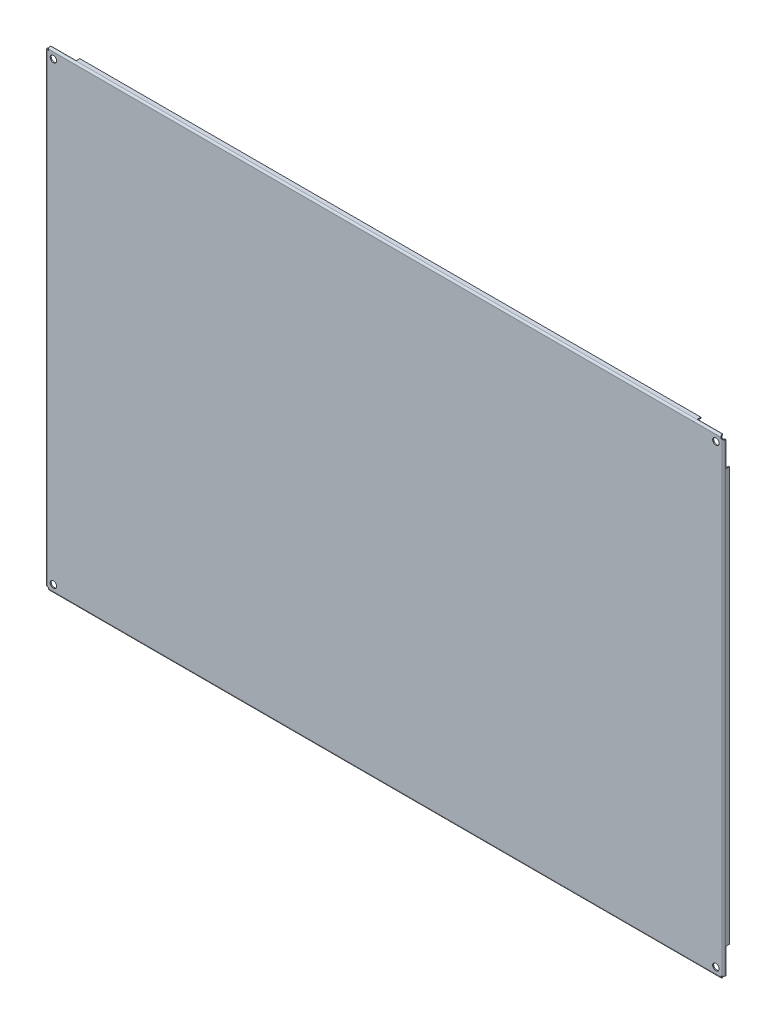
ISO-10303-21;
HEADER;
FILE_DESCRIPTION(('STEP AP214'),'2;1');
FILE_NAME('part.step','',(''),(''),'','','');
FILE_SCHEMA(('AUTOMOTIVE_DESIGN { 1 0 10303 214 1 1 1 1 }'));
ENDSEC;
DATA;
#1=APPLICATION_CONTEXT('core data for automotive mechanical design processes');
#2=APPLICATION_PROTOCOL_DEFINITION('international standard','automotive_design',2000,#1);
#3=PRODUCT_CONTEXT('',#1,'mechanical');
#4=PRODUCT('Part','Part','',(#3));
#5=PRODUCT_RELATED_PRODUCT_CATEGORY('part','',(#4));
#6=PRODUCT_DEFINITION_FORMATION('','',#4);
#7=PRODUCT_DEFINITION_CONTEXT('part definition',#1,'design');
#8=PRODUCT_DEFINITION('design','',#6,#7);
#9=PRODUCT_DEFINITION_SHAPE('','',#8);
#10=(LENGTH_UNIT() NAMED_UNIT(*) SI_UNIT(.MILLI.,.METRE.));
#11=(NAMED_UNIT(*) PLANE_ANGLE_UNIT() SI_UNIT($,.RADIAN.));
#12=(NAMED_UNIT(*) SI_UNIT($,.STERADIAN.) SOLID_ANGLE_UNIT());
#13=UNCERTAINTY_MEASURE_WITH_UNIT(LENGTH_MEASURE(1.E-05),#10,'distance_accuracy_value','');
#14=(GEOMETRIC_REPRESENTATION_CONTEXT(3) GLOBAL_UNCERTAINTY_ASSIGNED_CONTEXT((#13)) GLOBAL_UNIT_ASSIGNED_CONTEXT((#10,
#11,#12)) REPRESENTATION_CONTEXT('',''));
#15=CARTESIAN_POINT('',(0.,0.,0.));
#16=DIRECTION('',(0.,0.,1.));
#17=DIRECTION('',(1.,0.,0.));
#18=AXIS2_PLACEMENT_3D('',#15,#16,#17);
#19=CARTESIAN_POINT('',(0.,1.5,0.));
#20=DIRECTION('',(0.,-1.,0.));
#21=DIRECTION('',(0.,0.,-1.));
#22=AXIS2_PLACEMENT_3D('',#19,#20,#21);
#23=PLANE('',#22);
#24=DIRECTION('',(1.,0.,0.));
#25=VECTOR('',#24,1.);
#26=CARTESIAN_POINT('',(0.,1.5,1.5));
#27=LINE('',#26,#25);
#28=CARTESIAN_POINT('',(-469.585786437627,1.5,1.5));
#29=VERTEX_POINT('',#28);
#30=CARTESIAN_POINT('',(469.585786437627,1.5,1.5));
#31=VERTEX_POINT('',#30);
#32=EDGE_CURVE('E320',#29,#31,#27,.T.);
#33=ORIENTED_EDGE('',*,*,#32,.T.);
#34=DIRECTION('',(0.,0.,1.));
#35=VECTOR('',#34,1.);
#36=CARTESIAN_POINT('',(469.585786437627,1.5,0.));
#37=LINE('',#36,#35);
#38=CARTESIAN_POINT('',(469.585786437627,1.5,1.));
#39=VERTEX_POINT('',#38);
#40=EDGE_CURVE('E1185',#31,#39,#37,.F.);
#41=ORIENTED_EDGE('',*,*,#40,.T.);
#42=DIRECTION('',(1.,0.,0.));
#43=VECTOR('',#42,1.);
#44=CARTESIAN_POINT('',(0.,1.5,1.));
#45=LINE('',#44,#43);
#46=CARTESIAN_POINT('',(434.,1.5,1.));
#47=VERTEX_POINT('',#46);
#48=EDGE_CURVE('E459',#39,#47,#45,.F.);
#49=ORIENTED_EDGE('',*,*,#48,.T.);
#50=DIRECTION('',(0.,0.,1.));
#51=VECTOR('',#50,1.);
#52=CARTESIAN_POINT('',(434.,1.5,0.));
#53=LINE('',#52,#51);
#54=CARTESIAN_POINT('',(434.,1.5,-4.));
#55=VERTEX_POINT('',#54);
#56=EDGE_CURVE('E466',#47,#55,#53,.F.);
#57=ORIENTED_EDGE('',*,*,#56,.T.);
#58=DIRECTION('',(1.,0.,0.));
#59=VECTOR('',#58,1.);
#60=CARTESIAN_POINT('',(0.,1.5,-4.));
#61=LINE('',#60,#59);
#62=CARTESIAN_POINT('',(-434.,1.5,-4.));
#63=VERTEX_POINT('',#62);
#64=EDGE_CURVE('E472',#55,#63,#61,.F.);
#65=ORIENTED_EDGE('',*,*,#64,.T.);
#66=DIRECTION('',(0.,0.,-1.));
#67=VECTOR('',#66,1.);
#68=CARTESIAN_POINT('',(-434.,1.5,0.));
#69=LINE('',#68,#67);
#70=CARTESIAN_POINT('',(-434.,1.5,1.));
#71=VERTEX_POINT('',#70);
#72=EDGE_CURVE('E478',#63,#71,#69,.F.);
#73=ORIENTED_EDGE('',*,*,#72,.T.);
#74=DIRECTION('',(-1.,0.,0.));
#75=VECTOR('',#74,1.);
#76=CARTESIAN_POINT('',(0.,1.5,1.));
#77=LINE('',#76,#75);
#78=CARTESIAN_POINT('',(-469.585786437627,1.5,1.));
#79=VERTEX_POINT('',#78);
#80=EDGE_CURVE('E481',#79,#71,#77,.F.);
#81=ORIENTED_EDGE('',*,*,#80,.F.);
#82=DIRECTION('',(0.,0.,-1.));
#83=VECTOR('',#82,1.);
#84=CARTESIAN_POINT('',(-469.585786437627,1.5,0.));
#85=LINE('',#84,#83);
#86=EDGE_CURVE('E1233',#79,#29,#85,.F.);
#87=ORIENTED_EDGE('',*,*,#86,.T.);
#88=EDGE_LOOP('',(#33,#41,#49,#57,#65,#73,#81,#87));
#89=FACE_BOUND('',#88,.T.);
#90=ADVANCED_FACE('F17',(#89),#23,.F.);
#91=CARTESIAN_POINT('',(-472.5,658.,4.));
#92=DIRECTION('',(1.,0.,0.));
#93=DIRECTION('',(0.,0.,-1.));
#94=AXIS2_PLACEMENT_3D('',#91,#92,#93);
#95=PLANE('',#94);
#96=DIRECTION('',(0.,0.,-1.));
#97=VECTOR('',#96,1.);
#98=CARTESIAN_POINT('',(-472.5,618.,4.));
#99=LINE('',#98,#97);
#100=CARTESIAN_POINT('',(-472.5,618.,-4.));
#101=VERTEX_POINT('',#100);
#102=CARTESIAN_POINT('',(-472.5,618.,1.));
#103=VERTEX_POINT('',#102);
#104=EDGE_CURVE('E1160',#101,#103,#99,.F.);
#105=ORIENTED_EDGE('',*,*,#104,.T.);
#106=DIRECTION('',(0.,1.,0.));
#107=VECTOR('',#106,1.);
#108=CARTESIAN_POINT('',(-472.5,658.,1.));
#109=LINE('',#108,#107);
#110=CARTESIAN_POINT('',(-472.5,653.585786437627,1.));
#111=VERTEX_POINT('',#110);
#112=EDGE_CURVE('E444',#103,#111,#109,.T.);
#113=ORIENTED_EDGE('',*,*,#112,.T.);
#114=DIRECTION('',(0.,0.,1.));
#115=VECTOR('',#114,1.);
#116=CARTESIAN_POINT('',(-472.5,653.585786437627,2.5));
#117=LINE('',#116,#115);
#118=CARTESIAN_POINT('',(-472.5,653.585786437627,1.5));
#119=VERTEX_POINT('',#118);
#120=EDGE_CURVE('E427',#119,#111,#117,.F.);
#121=ORIENTED_EDGE('',*,*,#120,.F.);
#122=DIRECTION('',(0.,1.,0.));
#123=VECTOR('',#122,1.);
#124=CARTESIAN_POINT('',(-472.5,658.,1.5));
#125=LINE('',#124,#123);
#126=CARTESIAN_POINT('',(-472.5,4.41421356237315,1.5));
#127=VERTEX_POINT('',#126);
#128=EDGE_CURVE('E945',#119,#127,#125,.F.);
#129=ORIENTED_EDGE('',*,*,#128,.T.);
#130=DIRECTION('',(0.,0.,-1.));
#131=VECTOR('',#130,1.);
#132=CARTESIAN_POINT('',(-472.5,4.41421356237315,4.));
#133=LINE('',#132,#131);
#134=CARTESIAN_POINT('',(-472.5,4.41421356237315,1.));
#135=VERTEX_POINT('',#134);
#136=EDGE_CURVE('E1151',#135,#127,#133,.F.);
#137=ORIENTED_EDGE('',*,*,#136,.F.);
#138=DIRECTION('',(0.,1.,0.));
#139=VECTOR('',#138,1.);
#140=CARTESIAN_POINT('',(-472.5,658.,1.));
#141=LINE('',#140,#139);
#142=CARTESIAN_POINT('',(-472.5,40.,1.));
#143=VERTEX_POINT('',#142);
#144=EDGE_CURVE('E424',#143,#135,#141,.F.);
#145=ORIENTED_EDGE('',*,*,#144,.F.);
#146=DIRECTION('',(0.,0.,1.));
#147=VECTOR('',#146,1.);
#148=CARTESIAN_POINT('',(-472.5,40.,4.));
#149=LINE('',#148,#147);
#150=CARTESIAN_POINT('',(-472.5,40.,-4.));
#151=VERTEX_POINT('',#150);
#152=EDGE_CURVE('E426',#143,#151,#149,.F.);
#153=ORIENTED_EDGE('',*,*,#152,.T.);
#154=DIRECTION('',(0.,1.,0.));
#155=VECTOR('',#154,1.);
#156=CARTESIAN_POINT('',(-472.5,658.,-4.));
#157=LINE('',#156,#155);
#158=EDGE_CURVE('E437',#151,#101,#157,.T.);
#159=ORIENTED_EDGE('',*,*,#158,.T.);
#160=EDGE_LOOP('',(#105,#113,#121,#129,#137,#145,#153,#159));
#161=FACE_BOUND('',#160,.T.);
#162=ADVANCED_FACE('F708',(#161),#95,.T.);
#163=CARTESIAN_POINT('',(0.,656.5,0.));
#164=DIRECTION('',(0.,-1.,0.));
#165=DIRECTION('',(0.,0.,-1.));
#166=AXIS2_PLACEMENT_3D('',#163,#164,#165);
#167=PLANE('',#166);
#168=DIRECTION('',(0.,0.,1.));
#169=VECTOR('',#168,1.);
#170=CARTESIAN_POINT('',(434.,656.5,0.));
#171=LINE('',#170,#169);
#172=CARTESIAN_POINT('',(434.,656.5,-4.));
#173=VERTEX_POINT('',#172);
#174=CARTESIAN_POINT('',(434.,656.5,1.));
#175=VERTEX_POINT('',#174);
#176=EDGE_CURVE('E1120',#173,#175,#171,.T.);
#177=ORIENTED_EDGE('',*,*,#176,.T.);
#178=DIRECTION('',(-1.,0.,0.));
#179=VECTOR('',#178,1.);
#180=CARTESIAN_POINT('',(0.,656.5,1.));
#181=LINE('',#180,#179);
#182=CARTESIAN_POINT('',(469.585786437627,656.5,1.));
#183=VERTEX_POINT('',#182);
#184=EDGE_CURVE('E389',#183,#175,#181,.T.);
#185=ORIENTED_EDGE('',*,*,#184,.F.);
#186=DIRECTION('',(0.,0.,-1.));
#187=VECTOR('',#186,1.);
#188=CARTESIAN_POINT('',(469.585786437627,656.5,2.5));
#189=LINE('',#188,#187);
#190=CARTESIAN_POINT('',(469.585786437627,656.5,1.5));
#191=VERTEX_POINT('',#190);
#192=EDGE_CURVE('E1134',#191,#183,#189,.T.);
#193=ORIENTED_EDGE('',*,*,#192,.F.);
#194=DIRECTION('',(-1.,0.,0.));
#195=VECTOR('',#194,1.);
#196=CARTESIAN_POINT('',(-474.,656.5,1.5));
#197=LINE('',#196,#195);
#198=CARTESIAN_POINT('',(-469.585786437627,656.5,1.5));
#199=VERTEX_POINT('',#198);
#200=EDGE_CURVE('E409',#191,#199,#197,.T.);
#201=ORIENTED_EDGE('',*,*,#200,.T.);
#202=DIRECTION('',(0.,0.,1.));
#203=VECTOR('',#202,1.);
#204=CARTESIAN_POINT('',(-469.585786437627,656.5,1.));
#205=LINE('',#204,#203);
#206=CARTESIAN_POINT('',(-469.585786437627,656.5,1.));
#207=VERTEX_POINT('',#206);
#208=EDGE_CURVE('E1140',#207,#199,#205,.T.);
#209=ORIENTED_EDGE('',*,*,#208,.F.);
#210=DIRECTION('',(1.,0.,0.));
#211=VECTOR('',#210,1.);
#212=CARTESIAN_POINT('',(0.,656.5,1.));
#213=LINE('',#212,#211);
#214=CARTESIAN_POINT('',(-434.,656.5,1.));
#215=VERTEX_POINT('',#214);
#216=EDGE_CURVE('E405',#207,#215,#213,.T.);
#217=ORIENTED_EDGE('',*,*,#216,.T.);
#218=DIRECTION('',(0.,0.,-1.));
#219=VECTOR('',#218,1.);
#220=CARTESIAN_POINT('',(-434.,656.5,0.));
#221=LINE('',#220,#219);
#222=CARTESIAN_POINT('',(-434.,656.5,-4.));
#223=VERTEX_POINT('',#222);
#224=EDGE_CURVE('E414',#215,#223,#221,.T.);
#225=ORIENTED_EDGE('',*,*,#224,.T.);
#226=DIRECTION('',(1.,0.,0.));
#227=VECTOR('',#226,1.);
#228=CARTESIAN_POINT('',(0.,656.5,-4.));
#229=LINE('',#228,#227);
#230=EDGE_CURVE('E1125',#223,#173,#229,.T.);
#231=ORIENTED_EDGE('',*,*,#230,.T.);
#232=EDGE_LOOP('',(#177,#185,#193,#201,#209,#217,#225,#231));
#233=FACE_BOUND('',#232,.T.);
#234=ADVANCED_FACE('F712',(#233),#167,.T.);
#235=CARTESIAN_POINT('',(472.5,658.,4.));
#236=DIRECTION('',(-1.,0.,0.));
#237=DIRECTION('',(0.,0.,1.));
#238=AXIS2_PLACEMENT_3D('',#235,#236,#237);
#239=PLANE('',#238);
#240=DIRECTION('',(0.,0.,1.));
#241=VECTOR('',#240,1.);
#242=CARTESIAN_POINT('',(472.5,40.,4.));
#243=LINE('',#242,#241);
#244=CARTESIAN_POINT('',(472.5,40.,-4.));
#245=VERTEX_POINT('',#244);
#246=CARTESIAN_POINT('',(472.5,40.,1.));
#247=VERTEX_POINT('',#246);
#248=EDGE_CURVE('E1092',#245,#247,#243,.T.);
#249=ORIENTED_EDGE('',*,*,#248,.T.);
#250=DIRECTION('',(0.,1.,0.));
#251=VECTOR('',#250,1.);
#252=CARTESIAN_POINT('',(472.5,658.,1.));
#253=LINE('',#252,#251);
#254=CARTESIAN_POINT('',(472.5,4.41421356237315,1.));
#255=VERTEX_POINT('',#254);
#256=EDGE_CURVE('E352',#247,#255,#253,.F.);
#257=ORIENTED_EDGE('',*,*,#256,.T.);
#258=DIRECTION('',(0.,0.,-1.));
#259=VECTOR('',#258,1.);
#260=CARTESIAN_POINT('',(472.5,4.41421356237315,4.));
#261=LINE('',#260,#259);
#262=CARTESIAN_POINT('',(472.5,4.41421356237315,1.5));
#263=VERTEX_POINT('',#262);
#264=EDGE_CURVE('E898',#263,#255,#261,.T.);
#265=ORIENTED_EDGE('',*,*,#264,.F.);
#266=DIRECTION('',(0.,1.,0.));
#267=VECTOR('',#266,1.);
#268=CARTESIAN_POINT('',(472.5,658.,1.5));
#269=LINE('',#268,#267);
#270=CARTESIAN_POINT('',(472.5,653.585786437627,1.5));
#271=VERTEX_POINT('',#270);
#272=EDGE_CURVE('E376',#263,#271,#269,.T.);
#273=ORIENTED_EDGE('',*,*,#272,.T.);
#274=DIRECTION('',(0.,0.,1.));
#275=VECTOR('',#274,1.);
#276=CARTESIAN_POINT('',(472.5,653.585786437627,1.));
#277=LINE('',#276,#275);
#278=CARTESIAN_POINT('',(472.5,653.585786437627,1.));
#279=VERTEX_POINT('',#278);
#280=EDGE_CURVE('E897',#279,#271,#277,.T.);
#281=ORIENTED_EDGE('',*,*,#280,.F.);
#282=DIRECTION('',(0.,1.,0.));
#283=VECTOR('',#282,1.);
#284=CARTESIAN_POINT('',(472.5,658.,1.));
#285=LINE('',#284,#283);
#286=CARTESIAN_POINT('',(472.5,618.,1.));
#287=VERTEX_POINT('',#286);
#288=EDGE_CURVE('E367',#287,#279,#285,.T.);
#289=ORIENTED_EDGE('',*,*,#288,.F.);
#290=DIRECTION('',(0.,0.,-1.));
#291=VECTOR('',#290,1.);
#292=CARTESIAN_POINT('',(472.5,618.,4.));
#293=LINE('',#292,#291);
#294=CARTESIAN_POINT('',(472.5,618.,-4.));
#295=VERTEX_POINT('',#294);
#296=EDGE_CURVE('E370',#287,#295,#293,.T.);
#297=ORIENTED_EDGE('',*,*,#296,.T.);
#298=DIRECTION('',(0.,1.,0.));
#299=VECTOR('',#298,1.);
#300=CARTESIAN_POINT('',(472.5,658.,-4.));
#301=LINE('',#300,#299);
#302=EDGE_CURVE('E1094',#245,#295,#301,.T.);
#303=ORIENTED_EDGE('',*,*,#302,.F.);
#304=EDGE_LOOP('',(#249,#257,#265,#273,#281,#289,#297,#303));
#305=FACE_BOUND('',#304,.T.);
#306=ADVANCED_FACE('F716',(#305),#239,.T.);
#307=CARTESIAN_POINT('',(-469.585786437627,1.5,0.));
#308=DIRECTION('',(1.,0.,0.));
#309=DIRECTION('',(0.,0.,-1.));
#310=AXIS2_PLACEMENT_3D('',#307,#308,#309);
#311=PLANE('',#310);
#312=DIRECTION('',(0.,0.,-1.));
#313=VECTOR('',#312,1.);
#314=CARTESIAN_POINT('',(-469.585786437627,0.,0.));
#315=LINE('',#314,#313);
#316=CARTESIAN_POINT('',(-469.585786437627,0.,1.5));
#317=VERTEX_POINT('',#316);
#318=CARTESIAN_POINT('',(-469.585786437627,0.,1.));
#319=VERTEX_POINT('',#318);
#320=EDGE_CURVE('E1230',#317,#319,#315,.T.);
#321=ORIENTED_EDGE('',*,*,#320,.F.);
#322=DIRECTION('',(0.,-1.,0.));
#323=VECTOR('',#322,1.);
#324=CARTESIAN_POINT('',(-469.585786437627,0.75,1.5));
#325=LINE('',#324,#323);
#326=EDGE_CURVE('E334',#29,#317,#325,.T.);
#327=ORIENTED_EDGE('',*,*,#326,.F.);
#328=ORIENTED_EDGE('',*,*,#86,.F.);
#329=DIRECTION('',(0.,1.,0.));
#330=VECTOR('',#329,1.);
#331=CARTESIAN_POINT('',(-469.585786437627,1.5,1.));
#332=LINE('',#331,#330);
#333=EDGE_CURVE('E485',#319,#79,#332,.T.);
#334=ORIENTED_EDGE('',*,*,#333,.F.);
#335=EDGE_LOOP('',(#321,#327,#328,#334));
#336=FACE_BOUND('',#335,.T.);
#337=ADVANCED_FACE('F720',(#336),#311,.F.);
#338=CARTESIAN_POINT('',(0.,1.5,1.));
#339=DIRECTION('',(0.,0.,-1.));
#340=DIRECTION('',(-1.,0.,0.));
#341=AXIS2_PLACEMENT_3D('',#338,#339,#340);
#342=PLANE('',#341);
#343=ORIENTED_EDGE('',*,*,#333,.T.);
#344=ORIENTED_EDGE('',*,*,#80,.T.);
#345=DIRECTION('',(0.,1.,0.));
#346=VECTOR('',#345,1.);
#347=CARTESIAN_POINT('',(-434.,1.5,1.));
#348=LINE('',#347,#346);
#349=CARTESIAN_POINT('',(-434.,0.,1.));
#350=VERTEX_POINT('',#349);
#351=EDGE_CURVE('E475',#71,#350,#348,.F.);
#352=ORIENTED_EDGE('',*,*,#351,.T.);
#353=DIRECTION('',(1.,0.,0.));
#354=VECTOR('',#353,1.);
#355=CARTESIAN_POINT('',(0.,0.,1.));
#356=LINE('',#355,#354);
#357=EDGE_CURVE('E325',#319,#350,#356,.T.);
#358=ORIENTED_EDGE('',*,*,#357,.F.);
#359=EDGE_LOOP('',(#343,#344,#352,#358));
#360=FACE_BOUND('',#359,.T.);
#361=ADVANCED_FACE('F724',(#360),#342,.T.);
#362=CARTESIAN_POINT('',(-434.,1.5,0.));
#363=DIRECTION('',(1.,0.,0.));
#364=DIRECTION('',(0.,0.,-1.));
#365=AXIS2_PLACEMENT_3D('',#362,#363,#364);
#366=PLANE('',#365);
#367=DIRECTION('',(0.,0.,-1.));
#368=VECTOR('',#367,1.);
#369=CARTESIAN_POINT('',(-434.,0.,0.));
#370=LINE('',#369,#368);
#371=CARTESIAN_POINT('',(-434.,0.,-4.));
#372=VERTEX_POINT('',#371);
#373=EDGE_CURVE('E1211',#350,#372,#370,.T.);
#374=ORIENTED_EDGE('',*,*,#373,.F.);
#375=ORIENTED_EDGE('',*,*,#351,.F.);
#376=ORIENTED_EDGE('',*,*,#72,.F.);
#377=DIRECTION('',(0.,1.,0.));
#378=VECTOR('',#377,1.);
#379=CARTESIAN_POINT('',(-434.,1.5,-4.));
#380=LINE('',#379,#378);
#381=EDGE_CURVE('E469',#63,#372,#380,.F.);
#382=ORIENTED_EDGE('',*,*,#381,.T.);
#383=EDGE_LOOP('',(#374,#375,#376,#382));
#384=FACE_BOUND('',#383,.T.);
#385=ADVANCED_FACE('F728',(#384),#366,.F.);
#386=CARTESIAN_POINT('',(0.,1.5,-4.));
#387=DIRECTION('',(0.,0.,1.));
#388=DIRECTION('',(1.,0.,0.));
#389=AXIS2_PLACEMENT_3D('',#386,#387,#388);
#390=PLANE('',#389);
#391=DIRECTION('',(1.,0.,0.));
#392=VECTOR('',#391,1.);
#393=CARTESIAN_POINT('',(0.,0.,-4.));
#394=LINE('',#393,#392);
#395=CARTESIAN_POINT('',(434.,0.,-4.));
#396=VERTEX_POINT('',#395);
#397=EDGE_CURVE('E1203',#372,#396,#394,.T.);
#398=ORIENTED_EDGE('',*,*,#397,.F.);
#399=ORIENTED_EDGE('',*,*,#381,.F.);
#400=ORIENTED_EDGE('',*,*,#64,.F.);
#401=DIRECTION('',(0.,1.,0.));
#402=VECTOR('',#401,1.);
#403=CARTESIAN_POINT('',(434.,1.5,-4.));
#404=LINE('',#403,#402);
#405=EDGE_CURVE('E463',#55,#396,#404,.F.);
#406=ORIENTED_EDGE('',*,*,#405,.T.);
#407=EDGE_LOOP('',(#398,#399,#400,#406));
#408=FACE_BOUND('',#407,.T.);
#409=ADVANCED_FACE('F732',(#408),#390,.F.);
#410=CARTESIAN_POINT('',(434.,1.5,0.));
#411=DIRECTION('',(-1.,0.,0.));
#412=DIRECTION('',(0.,0.,1.));
#413=AXIS2_PLACEMENT_3D('',#410,#411,#412);
#414=PLANE('',#413);
#415=DIRECTION('',(0.,0.,-1.));
#416=VECTOR('',#415,1.);
#417=CARTESIAN_POINT('',(434.,0.,0.));
#418=LINE('',#417,#416);
#419=CARTESIAN_POINT('',(434.,0.,1.));
#420=VERTEX_POINT('',#419);
#421=EDGE_CURVE('E1195',#396,#420,#418,.F.);
#422=ORIENTED_EDGE('',*,*,#421,.F.);
#423=ORIENTED_EDGE('',*,*,#405,.F.);
#424=ORIENTED_EDGE('',*,*,#56,.F.);
#425=DIRECTION('',(0.,1.,0.));
#426=VECTOR('',#425,1.);
#427=CARTESIAN_POINT('',(434.,1.5,1.));
#428=LINE('',#427,#426);
#429=EDGE_CURVE('E462',#47,#420,#428,.F.);
#430=ORIENTED_EDGE('',*,*,#429,.T.);
#431=EDGE_LOOP('',(#422,#423,#424,#430));
#432=FACE_BOUND('',#431,.T.);
#433=ADVANCED_FACE('F736',(#432),#414,.F.);
#434=CARTESIAN_POINT('',(0.,1.5,1.));
#435=DIRECTION('',(0.,0.,1.));
#436=DIRECTION('',(1.,0.,0.));
#437=AXIS2_PLACEMENT_3D('',#434,#435,#436);
#438=PLANE('',#437);
#439=DIRECTION('',(1.,0.,0.));
#440=VECTOR('',#439,1.);
#441=CARTESIAN_POINT('',(0.,0.,1.));
#442=LINE('',#441,#440);
#443=CARTESIAN_POINT('',(469.585786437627,0.,1.));
#444=VERTEX_POINT('',#443);
#445=EDGE_CURVE('E1084',#420,#444,#442,.T.);
#446=ORIENTED_EDGE('',*,*,#445,.F.);
#447=ORIENTED_EDGE('',*,*,#429,.F.);
#448=ORIENTED_EDGE('',*,*,#48,.F.);
#449=DIRECTION('',(0.,1.,0.));
#450=VECTOR('',#449,1.);
#451=CARTESIAN_POINT('',(469.585786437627,1.5,1.));
#452=LINE('',#451,#450);
#453=EDGE_CURVE('E1184',#39,#444,#452,.F.);
#454=ORIENTED_EDGE('',*,*,#453,.T.);
#455=EDGE_LOOP('',(#446,#447,#448,#454));
#456=FACE_BOUND('',#455,.T.);
#457=ADVANCED_FACE('F740',(#456),#438,.F.);
#458=CARTESIAN_POINT('',(469.585786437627,1.5,0.));
#459=DIRECTION('',(-1.,0.,0.));
#460=DIRECTION('',(0.,0.,1.));
#461=AXIS2_PLACEMENT_3D('',#458,#459,#460);
#462=PLANE('',#461);
#463=DIRECTION('',(0.,0.,-1.));
#464=VECTOR('',#463,1.);
#465=CARTESIAN_POINT('',(469.585786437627,0.,0.));
#466=LINE('',#465,#464);
#467=CARTESIAN_POINT('',(469.585786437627,0.,1.5));
#468=VERTEX_POINT('',#467);
#469=EDGE_CURVE('E1082',#444,#468,#466,.F.);
#470=ORIENTED_EDGE('',*,*,#469,.F.);
#471=ORIENTED_EDGE('',*,*,#453,.F.);
#472=ORIENTED_EDGE('',*,*,#40,.F.);
#473=DIRECTION('',(0.,1.,0.));
#474=VECTOR('',#473,1.);
#475=CARTESIAN_POINT('',(469.585786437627,0.75,1.5));
#476=LINE('',#475,#474);
#477=EDGE_CURVE('E1079',#468,#31,#476,.T.);
#478=ORIENTED_EDGE('',*,*,#477,.F.);
#479=EDGE_LOOP('',(#470,#471,#472,#478));
#480=FACE_BOUND('',#479,.T.);
#481=ADVANCED_FACE('F744',(#480),#462,.F.);
#482=CARTESIAN_POINT('',(0.,2.5,1.5));
#483=DIRECTION('',(1.,0.,0.));
#484=DIRECTION('',(0.,0.,-1.));
#485=AXIS2_PLACEMENT_3D('',#482,#483,#484);
#486=CYLINDRICAL_SURFACE('',#485,1.);
#487=DIRECTION('',(-1.,0.,0.));
#488=VECTOR('',#487,1.);
#489=CARTESIAN_POINT('',(-474.,2.49999999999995,2.5));
#490=LINE('',#489,#488);
#491=CARTESIAN_POINT('',(470.,2.49999999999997,2.5));
#492=VERTEX_POINT('',#491);
#493=CARTESIAN_POINT('',(-470.,2.49999999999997,2.5));
#494=VERTEX_POINT('',#493);
#495=EDGE_CURVE('E303',#492,#494,#490,.T.);
#496=ORIENTED_EDGE('',*,*,#495,.F.);
#497=CARTESIAN_POINT('',(469.585786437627,1.5,1.5));
#498=CARTESIAN_POINT('',(469.585791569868,1.49999628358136,1.52396943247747));
#499=CARTESIAN_POINT('',(469.586773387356,1.50086202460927,1.54790535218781));
#500=CARTESIAN_POINT('',(469.59040038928,1.5042849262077,1.59548683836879));
#501=CARTESIAN_POINT('',(469.593042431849,1.5068388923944,1.61913286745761));
#502=CARTESIAN_POINT('',(469.602973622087,1.51690809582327,1.68902809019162));
#503=CARTESIAN_POINT('',(469.612278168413,1.52683242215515,1.73465915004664));
#504=CARTESIAN_POINT('',(469.634406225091,1.5524597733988,1.82290837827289));
#505=CARTESIAN_POINT('',(469.647204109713,1.56812099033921,1.86554574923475));
#506=CARTESIAN_POINT('',(469.675097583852,1.60472845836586,1.94779358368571));
#507=CARTESIAN_POINT('',(469.690198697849,1.62568749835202,1.98739641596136));
#508=CARTESIAN_POINT('',(469.724891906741,1.67708899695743,2.07067351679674));
#509=CARTESIAN_POINT('',(469.744777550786,1.70859020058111,2.11357339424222));
#510=CARTESIAN_POINT('',(469.785118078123,1.77781181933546,2.19372196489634));
#511=CARTESIAN_POINT('',(469.805573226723,1.81553517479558,2.2309679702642));
#512=CARTESIAN_POINT('',(469.848385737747,1.90177399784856,2.30355152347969));
#513=CARTESIAN_POINT('',(469.870653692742,1.95105201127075,2.33804227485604));
#514=CARTESIAN_POINT('',(469.912397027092,2.05594692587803,2.39803056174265));
#515=CARTESIAN_POINT('',(469.931873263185,2.11156187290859,2.42353085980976));
#516=CARTESIAN_POINT('',(469.960415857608,2.21091169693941,2.45829782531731));
#517=CARTESIAN_POINT('',(469.970860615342,2.25335960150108,2.47013135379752));
#518=CARTESIAN_POINT('',(469.987595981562,2.34014417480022,2.48812321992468));
#519=CARTESIAN_POINT('',(469.993903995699,2.3844720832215,2.494305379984));
#520=CARTESIAN_POINT('',(469.999036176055,2.45272027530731,2.49916544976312));
#521=CARTESIAN_POINT('',(469.999990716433,2.47635018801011,2.50001170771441));
#522=CARTESIAN_POINT('',(470.,2.5,2.5));
#523=B_SPLINE_CURVE_WITH_KNOTS('',3,(#497,#498,#499,#500,#501,#502,#503,#504,#505,#506,#507,
#508,#509,#510,#511,#512,#513,#514,#515,#516,#517,#518,#519,#520,#521,#522),.UNSPECIFIED.,.F.,
.F.,(4,2,2,2,2,2,2,2,2,2,2,2,4),(0.,0.0718194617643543,0.143503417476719,0.285617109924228,
0.42671509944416,0.568157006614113,0.737942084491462,0.907807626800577,1.09930104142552,
1.29073556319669,1.42614133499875,1.56097365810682,1.63186947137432),.UNSPECIFIED.);
#524=EDGE_CURVE('E632',#31,#492,#523,.T.);
#525=ORIENTED_EDGE('',*,*,#524,.F.);
#526=ORIENTED_EDGE('',*,*,#32,.F.);
#527=CARTESIAN_POINT('',(-470.,2.5,2.5));
#528=CARTESIAN_POINT('',(-469.999994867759,2.47603056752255,2.50000371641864));
#529=CARTESIAN_POINT('',(-469.999013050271,2.45209464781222,2.49913797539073));
#530=CARTESIAN_POINT('',(-469.995386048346,2.40451316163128,2.49571507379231));
#531=CARTESIAN_POINT('',(-469.992744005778,2.38086713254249,2.49316110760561));
#532=CARTESIAN_POINT('',(-469.98281281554,2.31097190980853,2.48309190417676));
#533=CARTESIAN_POINT('',(-469.973508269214,2.26534084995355,2.4731675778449));
#534=CARTESIAN_POINT('',(-469.951380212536,2.17709162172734,2.44754022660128));
#535=CARTESIAN_POINT('',(-469.938582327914,2.13445425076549,2.43187900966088));
#536=CARTESIAN_POINT('',(-469.910688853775,2.05220641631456,2.39527154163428));
#537=CARTESIAN_POINT('',(-469.895587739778,2.01260358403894,2.37431250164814));
#538=CARTESIAN_POINT('',(-469.860894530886,1.92932648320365,2.32291100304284));
#539=CARTESIAN_POINT('',(-469.841008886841,1.88642660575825,2.29140979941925));
#540=CARTESIAN_POINT('',(-469.800668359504,1.80627803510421,2.22218818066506));
#541=CARTESIAN_POINT('',(-469.780213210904,1.76903202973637,2.18446482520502));
#542=CARTESIAN_POINT('',(-469.73740069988,1.69644847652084,2.09822600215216));
#543=CARTESIAN_POINT('',(-469.715132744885,1.66195772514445,2.04894798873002));
#544=CARTESIAN_POINT('',(-469.673389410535,1.60196943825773,1.94405307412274));
#545=CARTESIAN_POINT('',(-469.653913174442,1.57646914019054,1.88843812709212));
#546=CARTESIAN_POINT('',(-469.625370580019,1.54170217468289,1.78908830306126));
#547=CARTESIAN_POINT('',(-469.614925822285,1.52986864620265,1.74664039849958));
#548=CARTESIAN_POINT('',(-469.598190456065,1.51187678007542,1.65985582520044));
#549=CARTESIAN_POINT('',(-469.591882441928,1.50569462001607,1.61552791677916));
#550=CARTESIAN_POINT('',(-469.586750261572,1.5008345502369,1.54727972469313));
#551=CARTESIAN_POINT('',(-469.585795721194,1.49998829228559,1.52364981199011));
#552=CARTESIAN_POINT('',(-469.585786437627,1.5,1.5));
#553=B_SPLINE_CURVE_WITH_KNOTS('',3,(#527,#528,#529,#530,#531,#532,#533,#534,#535,#536,#537,
#538,#539,#540,#541,#542,#543,#544,#545,#546,#547,#548,#549,#550,#551,#552),.UNSPECIFIED.,.F.,
.F.,(4,2,2,2,2,2,2,2,2,2,2,2,4),(0.,0.0718194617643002,0.143503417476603,0.285617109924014,
0.42671509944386,0.568157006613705,0.737942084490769,0.907807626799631,1.09930104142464,
1.29073556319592,1.42614133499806,1.56097365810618,1.63186947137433),.UNSPECIFIED.);
#554=EDGE_CURVE('E24',#494,#29,#553,.T.);
#555=ORIENTED_EDGE('',*,*,#554,.F.);
#556=EDGE_LOOP('',(#496,#525,#526,#555));
#557=FACE_BOUND('',#556,.T.);
#558=ADVANCED_FACE('F318',(#557),#486,.F.);
#559=CARTESIAN_POINT('',(-472.5,653.585786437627,2.5));
#560=DIRECTION('',(0.,1.,0.));
#561=DIRECTION('',(0.,0.,1.));
#562=AXIS2_PLACEMENT_3D('',#559,#560,#561);
#563=PLANE('',#562);
#564=DIRECTION('',(-1.,0.,0.));
#565=VECTOR('',#564,1.);
#566=CARTESIAN_POINT('',(-473.25,653.585786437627,1.5));
#567=LINE('',#566,#565);
#568=CARTESIAN_POINT('',(-474.,653.585786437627,1.5));
#569=VERTEX_POINT('',#568);
#570=EDGE_CURVE('E953',#119,#569,#567,.T.);
#571=ORIENTED_EDGE('',*,*,#570,.F.);
#572=ORIENTED_EDGE('',*,*,#120,.T.);
#573=DIRECTION('',(1.,0.,0.));
#574=VECTOR('',#573,1.);
#575=CARTESIAN_POINT('',(-472.5,653.585786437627,1.));
#576=LINE('',#575,#574);
#577=CARTESIAN_POINT('',(-474.,653.585786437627,1.));
#578=VERTEX_POINT('',#577);
#579=EDGE_CURVE('E440',#111,#578,#576,.F.);
#580=ORIENTED_EDGE('',*,*,#579,.T.);
#581=DIRECTION('',(0.,0.,1.));
#582=VECTOR('',#581,1.);
#583=CARTESIAN_POINT('',(-474.,653.585786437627,2.5));
#584=LINE('',#583,#582);
#585=EDGE_CURVE('E1177',#578,#569,#584,.T.);
#586=ORIENTED_EDGE('',*,*,#585,.T.);
#587=EDGE_LOOP('',(#571,#572,#580,#586));
#588=FACE_BOUND('',#587,.T.);
#589=ADVANCED_FACE('F751',(#588),#563,.T.);
#590=CARTESIAN_POINT('',(-472.5,658.,1.));
#591=DIRECTION('',(0.,0.,-1.));
#592=DIRECTION('',(-1.,0.,0.));
#593=AXIS2_PLACEMENT_3D('',#590,#591,#592);
#594=PLANE('',#593);
#595=DIRECTION('',(1.,0.,0.));
#596=VECTOR('',#595,1.);
#597=CARTESIAN_POINT('',(-472.5,40.,1.));
#598=LINE('',#597,#596);
#599=CARTESIAN_POINT('',(-474.,40.,1.));
#600=VERTEX_POINT('',#599);
#601=EDGE_CURVE('E432',#600,#143,#598,.T.);
#602=ORIENTED_EDGE('',*,*,#601,.T.);
#603=ORIENTED_EDGE('',*,*,#144,.T.);
#604=DIRECTION('',(1.,0.,0.));
#605=VECTOR('',#604,1.);
#606=CARTESIAN_POINT('',(-472.5,4.41421356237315,1.));
#607=LINE('',#606,#605);
#608=CARTESIAN_POINT('',(-474.,4.41421356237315,1.));
#609=VERTEX_POINT('',#608);
#610=EDGE_CURVE('E1153',#609,#135,#607,.T.);
#611=ORIENTED_EDGE('',*,*,#610,.F.);
#612=DIRECTION('',(0.,1.,0.));
#613=VECTOR('',#612,1.);
#614=CARTESIAN_POINT('',(-474.,658.,1.));
#615=LINE('',#614,#613);
#616=EDGE_CURVE('E1071',#609,#600,#615,.T.);
#617=ORIENTED_EDGE('',*,*,#616,.T.);
#618=EDGE_LOOP('',(#602,#603,#611,#617));
#619=FACE_BOUND('',#618,.T.);
#620=ADVANCED_FACE('F755',(#619),#594,.T.);
#621=CARTESIAN_POINT('',(-472.5,40.,4.));
#622=DIRECTION('',(0.,1.,0.));
#623=DIRECTION('',(0.,0.,1.));
#624=AXIS2_PLACEMENT_3D('',#621,#622,#623);
#625=PLANE('',#624);
#626=DIRECTION('',(0.,0.,-1.));
#627=VECTOR('',#626,1.);
#628=CARTESIAN_POINT('',(-474.,40.,4.));
#629=LINE('',#628,#627);
#630=CARTESIAN_POINT('',(-474.,40.,-4.));
#631=VERTEX_POINT('',#630);
#632=EDGE_CURVE('E1068',#600,#631,#629,.T.);
#633=ORIENTED_EDGE('',*,*,#632,.T.);
#634=DIRECTION('',(1.,0.,0.));
#635=VECTOR('',#634,1.);
#636=CARTESIAN_POINT('',(-472.5,40.,-4.));
#637=LINE('',#636,#635);
#638=EDGE_CURVE('E1163',#631,#151,#637,.T.);
#639=ORIENTED_EDGE('',*,*,#638,.T.);
#640=ORIENTED_EDGE('',*,*,#152,.F.);
#641=ORIENTED_EDGE('',*,*,#601,.F.);
#642=EDGE_LOOP('',(#633,#639,#640,#641));
#643=FACE_BOUND('',#642,.T.);
#644=ADVANCED_FACE('F759',(#643),#625,.F.);
#645=CARTESIAN_POINT('',(-472.5,658.,-4.));
#646=DIRECTION('',(0.,0.,1.));
#647=DIRECTION('',(1.,0.,0.));
#648=AXIS2_PLACEMENT_3D('',#645,#646,#647);
#649=PLANE('',#648);
#650=DIRECTION('',(0.,1.,0.));
#651=VECTOR('',#650,1.);
#652=CARTESIAN_POINT('',(-474.,658.,-4.));
#653=LINE('',#652,#651);
#654=CARTESIAN_POINT('',(-474.,618.,-4.));
#655=VERTEX_POINT('',#654);
#656=EDGE_CURVE('E1065',#631,#655,#653,.T.);
#657=ORIENTED_EDGE('',*,*,#656,.T.);
#658=DIRECTION('',(1.,0.,0.));
#659=VECTOR('',#658,1.);
#660=CARTESIAN_POINT('',(-472.5,618.,-4.));
#661=LINE('',#660,#659);
#662=EDGE_CURVE('E449',#655,#101,#661,.T.);
#663=ORIENTED_EDGE('',*,*,#662,.T.);
#664=ORIENTED_EDGE('',*,*,#158,.F.);
#665=ORIENTED_EDGE('',*,*,#638,.F.);
#666=EDGE_LOOP('',(#657,#663,#664,#665));
#667=FACE_BOUND('',#666,.T.);
#668=ADVANCED_FACE('F763',(#667),#649,.F.);
#669=CARTESIAN_POINT('',(-472.5,618.,4.));
#670=DIRECTION('',(0.,-1.,0.));
#671=DIRECTION('',(0.,0.,-1.));
#672=AXIS2_PLACEMENT_3D('',#669,#670,#671);
#673=PLANE('',#672);
#674=DIRECTION('',(0.,0.,-1.));
#675=VECTOR('',#674,1.);
#676=CARTESIAN_POINT('',(-474.,618.,4.));
#677=LINE('',#676,#675);
#678=CARTESIAN_POINT('',(-474.,618.,1.));
#679=VERTEX_POINT('',#678);
#680=EDGE_CURVE('E456',#655,#679,#677,.F.);
#681=ORIENTED_EDGE('',*,*,#680,.T.);
#682=DIRECTION('',(1.,0.,0.));
#683=VECTOR('',#682,1.);
#684=CARTESIAN_POINT('',(-472.5,618.,1.));
#685=LINE('',#684,#683);
#686=EDGE_CURVE('E443',#679,#103,#685,.T.);
#687=ORIENTED_EDGE('',*,*,#686,.T.);
#688=ORIENTED_EDGE('',*,*,#104,.F.);
#689=ORIENTED_EDGE('',*,*,#662,.F.);
#690=EDGE_LOOP('',(#681,#687,#688,#689));
#691=FACE_BOUND('',#690,.T.);
#692=ADVANCED_FACE('F767',(#691),#673,.F.);
#693=CARTESIAN_POINT('',(-472.5,658.,1.));
#694=DIRECTION('',(0.,0.,1.));
#695=DIRECTION('',(1.,0.,0.));
#696=AXIS2_PLACEMENT_3D('',#693,#694,#695);
#697=PLANE('',#696);
#698=DIRECTION('',(0.,1.,0.));
#699=VECTOR('',#698,1.);
#700=CARTESIAN_POINT('',(-474.,658.,1.));
#701=LINE('',#700,#699);
#702=EDGE_CURVE('E452',#679,#578,#701,.T.);
#703=ORIENTED_EDGE('',*,*,#702,.T.);
#704=ORIENTED_EDGE('',*,*,#579,.F.);
#705=ORIENTED_EDGE('',*,*,#112,.F.);
#706=ORIENTED_EDGE('',*,*,#686,.F.);
#707=EDGE_LOOP('',(#703,#704,#705,#706));
#708=FACE_BOUND('',#707,.T.);
#709=ADVANCED_FACE('F770',(#708),#697,.F.);
#710=CARTESIAN_POINT('',(-472.5,4.41421356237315,4.));
#711=DIRECTION('',(0.,-1.,0.));
#712=DIRECTION('',(0.,0.,-1.));
#713=AXIS2_PLACEMENT_3D('',#710,#711,#712);
#714=PLANE('',#713);
#715=ORIENTED_EDGE('',*,*,#610,.T.);
#716=ORIENTED_EDGE('',*,*,#136,.T.);
#717=DIRECTION('',(1.,0.,0.));
#718=VECTOR('',#717,1.);
#719=CARTESIAN_POINT('',(-473.25,4.41421356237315,1.5));
#720=LINE('',#719,#718);
#721=CARTESIAN_POINT('',(-474.,4.41421356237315,1.5));
#722=VERTEX_POINT('',#721);
#723=EDGE_CURVE('E455',#722,#127,#720,.T.);
#724=ORIENTED_EDGE('',*,*,#723,.F.);
#725=DIRECTION('',(0.,0.,-1.));
#726=VECTOR('',#725,1.);
#727=CARTESIAN_POINT('',(-474.,4.41421356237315,4.));
#728=LINE('',#727,#726);
#729=EDGE_CURVE('E630',#722,#609,#728,.T.);
#730=ORIENTED_EDGE('',*,*,#729,.T.);
#731=EDGE_LOOP('',(#715,#716,#724,#730));
#732=FACE_BOUND('',#731,.T.);
#733=ADVANCED_FACE('F621',(#732),#714,.T.);
#734=CARTESIAN_POINT('',(-471.5,658.,1.5));
#735=DIRECTION('',(0.,1.,0.));
#736=DIRECTION('',(0.,0.,1.));
#737=AXIS2_PLACEMENT_3D('',#734,#735,#736);
#738=CYLINDRICAL_SURFACE('',#737,1.);
#739=DIRECTION('',(0.,1.,0.));
#740=VECTOR('',#739,1.);
#741=CARTESIAN_POINT('',(-471.5,658.,2.5));
#742=LINE('',#741,#740);
#743=CARTESIAN_POINT('',(-471.5,4.,2.5));
#744=VERTEX_POINT('',#743);
#745=CARTESIAN_POINT('',(-471.5,654.,2.5));
#746=VERTEX_POINT('',#745);
#747=EDGE_CURVE('E341',#744,#746,#742,.T.);
#748=ORIENTED_EDGE('',*,*,#747,.F.);
#749=CARTESIAN_POINT('',(-472.5,4.41421356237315,1.5));
#750=CARTESIAN_POINT('',(-472.500003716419,4.41420843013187,1.52396943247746));
#751=CARTESIAN_POINT('',(-472.499137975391,4.41322661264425,1.5479053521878));
#752=CARTESIAN_POINT('',(-472.495715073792,4.4095996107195,1.59548683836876));
#753=CARTESIAN_POINT('',(-472.493161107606,4.4069575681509,1.61913286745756));
#754=CARTESIAN_POINT('',(-472.483091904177,4.39702637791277,1.68902809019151));
#755=CARTESIAN_POINT('',(-472.473167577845,4.38772183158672,1.73465915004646));
#756=CARTESIAN_POINT('',(-472.447540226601,4.36559377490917,1.82290837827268));
#757=CARTESIAN_POINT('',(-472.431879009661,4.35279589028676,1.86554574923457));
#758=CARTESIAN_POINT('',(-472.395271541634,4.32490241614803,1.9477935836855));
#759=CARTESIAN_POINT('',(-472.374312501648,4.30980130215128,1.98739641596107));
#760=CARTESIAN_POINT('',(-472.322911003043,4.2751080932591,2.07067351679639));
#761=CARTESIAN_POINT('',(-472.291409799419,4.25522244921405,2.11357339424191));
#762=CARTESIAN_POINT('',(-472.222188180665,4.21488192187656,2.19372196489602));
#763=CARTESIAN_POINT('',(-472.184464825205,4.19442677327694,2.23096797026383));
#764=CARTESIAN_POINT('',(-472.098226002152,4.15161426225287,2.30355152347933));
#765=CARTESIAN_POINT('',(-472.04894798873,4.12934630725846,2.33804227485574));
#766=CARTESIAN_POINT('',(-471.944053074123,4.08760297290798,2.39803056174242));
#767=CARTESIAN_POINT('',(-471.888438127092,4.06812673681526,2.42353085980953));
#768=CARTESIAN_POINT('',(-471.789088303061,4.03958414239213,2.45829782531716));
#769=CARTESIAN_POINT('',(-471.746640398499,4.02913938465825,2.47013135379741));
#770=CARTESIAN_POINT('',(-471.6598558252,4.01240401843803,2.48812321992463));
#771=CARTESIAN_POINT('',(-471.615527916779,4.00609600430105,2.49430537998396));
#772=CARTESIAN_POINT('',(-471.547279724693,4.00096382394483,2.4991654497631));
#773=CARTESIAN_POINT('',(-471.52364981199,4.00000928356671,2.5000117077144));
#774=CARTESIAN_POINT('',(-471.5,4.,2.5));
#775=B_SPLINE_CURVE_WITH_KNOTS('',3,(#749,#750,#751,#752,#753,#754,#755,#756,#757,#758,#759,
#760,#761,#762,#763,#764,#765,#766,#767,#768,#769,#770,#771,#772,#773,#774),.UNSPECIFIED.,.F.,
.F.,(4,2,2,2,2,2,2,2,2,2,2,2,4),(0.,0.0718194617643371,0.143503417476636,0.285617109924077,
0.426715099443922,0.568157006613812,0.737942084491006,0.907807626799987,1.09930104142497,
1.29073556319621,1.42614133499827,1.56097365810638,1.63186947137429),.UNSPECIFIED.);
#776=EDGE_CURVE('E595',#127,#744,#775,.T.);
#777=ORIENTED_EDGE('',*,*,#776,.F.);
#778=ORIENTED_EDGE('',*,*,#128,.F.);
#779=CARTESIAN_POINT('',(-471.5,654.,2.5));
#780=CARTESIAN_POINT('',(-471.523969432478,653.999994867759,2.50000371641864));
#781=CARTESIAN_POINT('',(-471.547905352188,653.999013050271,2.49913797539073));
#782=CARTESIAN_POINT('',(-471.595486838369,653.995386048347,2.4957150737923));
#783=CARTESIAN_POINT('',(-471.619132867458,653.992744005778,2.4931611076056));
#784=CARTESIAN_POINT('',(-471.689028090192,653.98281281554,2.48309190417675));
#785=CARTESIAN_POINT('',(-471.734659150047,653.973508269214,2.47316757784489));
#786=CARTESIAN_POINT('',(-471.822908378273,653.951380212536,2.44754022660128));
#787=CARTESIAN_POINT('',(-471.865545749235,653.938582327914,2.43187900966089));
#788=CARTESIAN_POINT('',(-471.947793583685,653.910688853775,2.39527154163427));
#789=CARTESIAN_POINT('',(-471.987396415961,653.895587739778,2.37431250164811));
#790=CARTESIAN_POINT('',(-472.070673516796,653.860894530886,2.32291100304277));
#791=CARTESIAN_POINT('',(-472.113573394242,653.841008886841,2.29140979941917));
#792=CARTESIAN_POINT('',(-472.193721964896,653.800668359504,2.22218818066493));
#793=CARTESIAN_POINT('',(-472.230967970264,653.780213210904,2.18446482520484));
#794=CARTESIAN_POINT('',(-472.303551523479,653.73740069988,2.09822600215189));
#795=CARTESIAN_POINT('',(-472.338042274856,653.715132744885,2.0489479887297));
#796=CARTESIAN_POINT('',(-472.398030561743,653.673389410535,1.94405307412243));
#797=CARTESIAN_POINT('',(-472.42353085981,653.653913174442,1.88843812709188));
#798=CARTESIAN_POINT('',(-472.458297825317,653.625370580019,1.78908830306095));
#799=CARTESIAN_POINT('',(-472.470131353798,653.614925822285,1.74664039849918));
#800=CARTESIAN_POINT('',(-472.488123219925,653.598190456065,1.65985582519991));
#801=CARTESIAN_POINT('',(-472.494305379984,653.591882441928,1.61552791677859));
#802=CARTESIAN_POINT('',(-472.499165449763,653.586750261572,1.54727972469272));
#803=CARTESIAN_POINT('',(-472.500011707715,653.585795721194,1.52364981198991));
#804=CARTESIAN_POINT('',(-472.5,653.585786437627,1.5));
#805=B_SPLINE_CURVE_WITH_KNOTS('',3,(#779,#780,#781,#782,#783,#784,#785,#786,#787,#788,#789,
#790,#791,#792,#793,#794,#795,#796,#797,#798,#799,#800,#801,#802,#803,#804),.UNSPECIFIED.,.F.,
.F.,(4,2,2,2,2,2,2,2,2,2,2,2,4),(0.,0.071819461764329,0.14350341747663,0.285617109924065,
0.426715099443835,0.568157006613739,0.737942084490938,0.907807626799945,1.099301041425,
1.2907355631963,1.42614133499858,1.56097365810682,1.63186947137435),.UNSPECIFIED.);
#806=EDGE_CURVE('E625',#746,#119,#805,.T.);
#807=ORIENTED_EDGE('',*,*,#806,.F.);
#808=EDGE_LOOP('',(#748,#777,#778,#807));
#809=FACE_BOUND('',#808,.T.);
#810=ADVANCED_FACE('F616',(#809),#738,.F.);
#811=CARTESIAN_POINT('',(-469.585786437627,656.5,1.));
#812=DIRECTION('',(-1.,0.,0.));
#813=DIRECTION('',(0.,0.,1.));
#814=AXIS2_PLACEMENT_3D('',#811,#812,#813);
#815=PLANE('',#814);
#816=DIRECTION('',(0.,1.,0.));
#817=VECTOR('',#816,1.);
#818=CARTESIAN_POINT('',(-469.585786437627,656.5,1.));
#819=LINE('',#818,#817);
#820=CARTESIAN_POINT('',(-469.585786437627,658.,1.));
#821=VERTEX_POINT('',#820);
#822=EDGE_CURVE('E408',#821,#207,#819,.F.);
#823=ORIENTED_EDGE('',*,*,#822,.T.);
#824=ORIENTED_EDGE('',*,*,#208,.T.);
#825=DIRECTION('',(0.,-1.,0.));
#826=VECTOR('',#825,1.);
#827=CARTESIAN_POINT('',(-469.585786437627,657.25,1.5));
#828=LINE('',#827,#826);
#829=CARTESIAN_POINT('',(-469.585786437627,658.,1.5));
#830=VERTEX_POINT('',#829);
#831=EDGE_CURVE('E590',#830,#199,#828,.T.);
#832=ORIENTED_EDGE('',*,*,#831,.F.);
#833=DIRECTION('',(0.,0.,1.));
#834=VECTOR('',#833,1.);
#835=CARTESIAN_POINT('',(-469.585786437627,658.,1.));
#836=LINE('',#835,#834);
#837=EDGE_CURVE('E1143',#830,#821,#836,.F.);
#838=ORIENTED_EDGE('',*,*,#837,.T.);
#839=EDGE_LOOP('',(#823,#824,#832,#838));
#840=FACE_BOUND('',#839,.T.);
#841=ADVANCED_FACE('F613',(#840),#815,.T.);
#842=CARTESIAN_POINT('',(469.585786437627,656.5,2.5));
#843=DIRECTION('',(1.,0.,0.));
#844=DIRECTION('',(0.,0.,-1.));
#845=AXIS2_PLACEMENT_3D('',#842,#843,#844);
#846=PLANE('',#845);
#847=DIRECTION('',(0.,1.,0.));
#848=VECTOR('',#847,1.);
#849=CARTESIAN_POINT('',(469.585786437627,657.25,1.5));
#850=LINE('',#849,#848);
#851=CARTESIAN_POINT('',(469.585786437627,658.,1.5));
#852=VERTEX_POINT('',#851);
#853=EDGE_CURVE('E589',#191,#852,#850,.T.);
#854=ORIENTED_EDGE('',*,*,#853,.F.);
#855=ORIENTED_EDGE('',*,*,#192,.T.);
#856=DIRECTION('',(0.,1.,0.));
#857=VECTOR('',#856,1.);
#858=CARTESIAN_POINT('',(469.585786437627,656.5,1.));
#859=LINE('',#858,#857);
#860=CARTESIAN_POINT('',(469.585786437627,658.,1.));
#861=VERTEX_POINT('',#860);
#862=EDGE_CURVE('E386',#861,#183,#859,.F.);
#863=ORIENTED_EDGE('',*,*,#862,.F.);
#864=DIRECTION('',(0.,0.,-1.));
#865=VECTOR('',#864,1.);
#866=CARTESIAN_POINT('',(469.585786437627,658.,2.5));
#867=LINE('',#866,#865);
#868=EDGE_CURVE('E1136',#861,#852,#867,.F.);
#869=ORIENTED_EDGE('',*,*,#868,.T.);
#870=EDGE_LOOP('',(#854,#855,#863,#869));
#871=FACE_BOUND('',#870,.T.);
#872=ADVANCED_FACE('F607',(#871),#846,.T.);
#873=CARTESIAN_POINT('',(-474.,655.5,1.5));
#874=DIRECTION('',(-1.,0.,0.));
#875=DIRECTION('',(0.,0.,1.));
#876=AXIS2_PLACEMENT_3D('',#873,#874,#875);
#877=CYLINDRICAL_SURFACE('',#876,1.);
#878=ORIENTED_EDGE('',*,*,#200,.F.);
#879=CARTESIAN_POINT('',(470.,655.5,2.5));
#880=CARTESIAN_POINT('',(469.999994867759,655.523969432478,2.50000371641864));
#881=CARTESIAN_POINT('',(469.999013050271,655.547905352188,2.49913797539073));
#882=CARTESIAN_POINT('',(469.995386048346,655.595486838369,2.49571507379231));
#883=CARTESIAN_POINT('',(469.992744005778,655.619132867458,2.49316110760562));
#884=CARTESIAN_POINT('',(469.98281281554,655.689028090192,2.48309190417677));
#885=CARTESIAN_POINT('',(469.973508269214,655.734659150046,2.47316757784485));
#886=CARTESIAN_POINT('',(469.951380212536,655.822908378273,2.44754022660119));
#887=CARTESIAN_POINT('',(469.938582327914,655.865545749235,2.4318790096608));
#888=CARTESIAN_POINT('',(469.910688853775,655.947793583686,2.39527154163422));
#889=CARTESIAN_POINT('',(469.895587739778,655.987396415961,2.37431250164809));
#890=CARTESIAN_POINT('',(469.860894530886,656.070673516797,2.3229110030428));
#891=CARTESIAN_POINT('',(469.841008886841,656.113573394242,2.2914097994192));
#892=CARTESIAN_POINT('',(469.800668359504,656.193721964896,2.22218818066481));
#893=CARTESIAN_POINT('',(469.780213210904,656.230967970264,2.18446482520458));
#894=CARTESIAN_POINT('',(469.73740069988,656.303551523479,2.09822600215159));
#895=CARTESIAN_POINT('',(469.715132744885,656.338042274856,2.04894798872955));
#896=CARTESIAN_POINT('',(469.673389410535,656.398030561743,1.9440530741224));
#897=CARTESIAN_POINT('',(469.653913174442,656.42353085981,1.88843812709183));
#898=CARTESIAN_POINT('',(469.625370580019,656.458297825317,1.78908830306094));
#899=CARTESIAN_POINT('',(469.614925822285,656.470131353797,1.74664039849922));
#900=CARTESIAN_POINT('',(469.598190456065,656.488123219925,1.65985582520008));
#901=CARTESIAN_POINT('',(469.591882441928,656.494305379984,1.61552791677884));
#902=CARTESIAN_POINT('',(469.586750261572,656.499165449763,1.54727972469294));
#903=CARTESIAN_POINT('',(469.585795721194,656.500011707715,1.52364981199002));
#904=CARTESIAN_POINT('',(469.585786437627,656.5,1.5));
#905=B_SPLINE_CURVE_WITH_KNOTS('',3,(#879,#880,#881,#882,#883,#884,#885,#886,#887,#888,#889,
#890,#891,#892,#893,#894,#895,#896,#897,#898,#899,#900,#901,#902,#903,#904),.UNSPECIFIED.,.F.,
.F.,(4,2,2,2,2,2,2,2,2,2,2,2,4),(0.,0.0718194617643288,0.143503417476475,0.285617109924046,
0.426715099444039,0.568157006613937,0.737942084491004,0.907807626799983,1.09930104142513,
1.29073556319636,1.4261413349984,1.56097365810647,1.63186947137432),.UNSPECIFIED.);
#906=CARTESIAN_POINT('',(470.,655.5,2.5));
#907=VERTEX_POINT('',#906);
#908=EDGE_CURVE('E421',#907,#191,#905,.T.);
#909=ORIENTED_EDGE('',*,*,#908,.F.);
#910=DIRECTION('',(-1.,0.,0.));
#911=VECTOR('',#910,1.);
#912=CARTESIAN_POINT('',(-474.,655.5,2.5));
#913=LINE('',#912,#911);
#914=CARTESIAN_POINT('',(-470.,655.5,2.5));
#915=VERTEX_POINT('',#914);
#916=EDGE_CURVE('E925',#915,#907,#913,.F.);
#917=ORIENTED_EDGE('',*,*,#916,.F.);
#918=CARTESIAN_POINT('',(-469.585786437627,656.5,1.5));
#919=CARTESIAN_POINT('',(-469.585791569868,656.500003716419,1.52396943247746));
#920=CARTESIAN_POINT('',(-469.586773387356,656.499137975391,1.54790535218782));
#921=CARTESIAN_POINT('',(-469.590400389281,656.495715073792,1.59548683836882));
#922=CARTESIAN_POINT('',(-469.593042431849,656.493161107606,1.61913286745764));
#923=CARTESIAN_POINT('',(-469.602973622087,656.483091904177,1.68902809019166));
#924=CARTESIAN_POINT('',(-469.612278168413,656.473167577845,1.73465915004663));
#925=CARTESIAN_POINT('',(-469.634406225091,656.447540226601,1.82290837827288));
#926=CARTESIAN_POINT('',(-469.647204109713,656.431879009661,1.86554574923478));
#927=CARTESIAN_POINT('',(-469.675097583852,656.395271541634,1.94779358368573));
#928=CARTESIAN_POINT('',(-469.690198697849,656.374312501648,1.98739641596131));
#929=CARTESIAN_POINT('',(-469.724891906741,656.322911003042,2.07067351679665));
#930=CARTESIAN_POINT('',(-469.744777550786,656.291409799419,2.11357339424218));
#931=CARTESIAN_POINT('',(-469.785118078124,656.222188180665,2.19372196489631));
#932=CARTESIAN_POINT('',(-469.805573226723,656.184464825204,2.23096797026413));
#933=CARTESIAN_POINT('',(-469.848385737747,656.098226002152,2.30355152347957));
#934=CARTESIAN_POINT('',(-469.870653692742,656.048947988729,2.33804227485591));
#935=CARTESIAN_POINT('',(-469.912397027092,655.944053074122,2.39803056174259));
#936=CARTESIAN_POINT('',(-469.931873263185,655.888438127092,2.42353085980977));
#937=CARTESIAN_POINT('',(-469.960415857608,655.789088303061,2.45829782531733));
#938=CARTESIAN_POINT('',(-469.970860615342,655.746640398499,2.47013135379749));
#939=CARTESIAN_POINT('',(-469.987595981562,655.6598558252,2.48812321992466));
#940=CARTESIAN_POINT('',(-469.993903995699,655.615527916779,2.49430537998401));
#941=CARTESIAN_POINT('',(-469.999036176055,655.547279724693,2.49916544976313));
#942=CARTESIAN_POINT('',(-469.999990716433,655.52364981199,2.50001170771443));
#943=CARTESIAN_POINT('',(-470.,655.5,2.5));
#944=B_SPLINE_CURVE_WITH_KNOTS('',3,(#918,#919,#920,#921,#922,#923,#924,#925,#926,#927,#928,
#929,#930,#931,#932,#933,#934,#935,#936,#937,#938,#939,#940,#941,#942,#943),.UNSPECIFIED.,.F.,
.F.,(4,2,2,2,2,2,2,2,2,2,2,2,4),(0.,0.0718194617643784,0.14350341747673,0.285617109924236,
0.426715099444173,0.568157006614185,0.737942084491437,0.907807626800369,1.09930104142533,
1.29073556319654,1.42614133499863,1.56097365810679,1.63186947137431),.UNSPECIFIED.);
#945=EDGE_CURVE('E581',#199,#915,#944,.T.);
#946=ORIENTED_EDGE('',*,*,#945,.F.);
#947=EDGE_LOOP('',(#878,#909,#917,#946));
#948=FACE_BOUND('',#947,.T.);
#949=ADVANCED_FACE('F601',(#948),#877,.F.);
#950=CARTESIAN_POINT('',(0.,656.5,1.));
#951=DIRECTION('',(0.,0.,1.));
#952=DIRECTION('',(1.,0.,0.));
#953=AXIS2_PLACEMENT_3D('',#950,#951,#952);
#954=PLANE('',#953);
#955=DIRECTION('',(1.,0.,0.));
#956=VECTOR('',#955,1.);
#957=CARTESIAN_POINT('',(0.,658.,1.));
#958=LINE('',#957,#956);
#959=CARTESIAN_POINT('',(-434.,658.,1.));
#960=VERTEX_POINT('',#959);
#961=EDGE_CURVE('E417',#821,#960,#958,.T.);
#962=ORIENTED_EDGE('',*,*,#961,.T.);
#963=DIRECTION('',(0.,1.,0.));
#964=VECTOR('',#963,1.);
#965=CARTESIAN_POINT('',(-434.,656.5,1.));
#966=LINE('',#965,#964);
#967=EDGE_CURVE('E1128',#960,#215,#966,.F.);
#968=ORIENTED_EDGE('',*,*,#967,.T.);
#969=ORIENTED_EDGE('',*,*,#216,.F.);
#970=ORIENTED_EDGE('',*,*,#822,.F.);
#971=EDGE_LOOP('',(#962,#968,#969,#970));
#972=FACE_BOUND('',#971,.T.);
#973=ADVANCED_FACE('F606',(#972),#954,.F.);
#974=CARTESIAN_POINT('',(-434.,656.5,0.));
#975=DIRECTION('',(1.,0.,0.));
#976=DIRECTION('',(0.,0.,-1.));
#977=AXIS2_PLACEMENT_3D('',#974,#975,#976);
#978=PLANE('',#977);
#979=DIRECTION('',(0.,0.,-1.));
#980=VECTOR('',#979,1.);
#981=CARTESIAN_POINT('',(-434.,658.,0.));
#982=LINE('',#981,#980);
#983=CARTESIAN_POINT('',(-434.,658.,-4.));
#984=VERTEX_POINT('',#983);
#985=EDGE_CURVE('E420',#960,#984,#982,.T.);
#986=ORIENTED_EDGE('',*,*,#985,.T.);
#987=DIRECTION('',(0.,1.,0.));
#988=VECTOR('',#987,1.);
#989=CARTESIAN_POINT('',(-434.,656.5,-4.));
#990=LINE('',#989,#988);
#991=EDGE_CURVE('E1122',#984,#223,#990,.F.);
#992=ORIENTED_EDGE('',*,*,#991,.T.);
#993=ORIENTED_EDGE('',*,*,#224,.F.);
#994=ORIENTED_EDGE('',*,*,#967,.F.);
#995=EDGE_LOOP('',(#986,#992,#993,#994));
#996=FACE_BOUND('',#995,.T.);
#997=ADVANCED_FACE('F1294',(#996),#978,.F.);
#998=CARTESIAN_POINT('',(0.,656.5,-4.));
#999=DIRECTION('',(0.,0.,1.));
#1000=DIRECTION('',(1.,0.,0.));
#1001=AXIS2_PLACEMENT_3D('',#998,#999,#1000);
#1002=PLANE('',#1001);
#1003=DIRECTION('',(1.,0.,0.));
#1004=VECTOR('',#1003,1.);
#1005=CARTESIAN_POINT('',(0.,658.,-4.));
#1006=LINE('',#1005,#1004);
#1007=CARTESIAN_POINT('',(434.,658.,-4.));
#1008=VERTEX_POINT('',#1007);
#1009=EDGE_CURVE('E1053',#984,#1008,#1006,.T.);
#1010=ORIENTED_EDGE('',*,*,#1009,.T.);
#1011=DIRECTION('',(0.,1.,0.));
#1012=VECTOR('',#1011,1.);
#1013=CARTESIAN_POINT('',(434.,656.5,-4.));
#1014=LINE('',#1013,#1012);
#1015=EDGE_CURVE('E1117',#1008,#173,#1014,.F.);
#1016=ORIENTED_EDGE('',*,*,#1015,.T.);
#1017=ORIENTED_EDGE('',*,*,#230,.F.);
#1018=ORIENTED_EDGE('',*,*,#991,.F.);
#1019=EDGE_LOOP('',(#1010,#1016,#1017,#1018));
#1020=FACE_BOUND('',#1019,.T.);
#1021=ADVANCED_FACE('F1291',(#1020),#1002,.F.);
#1022=CARTESIAN_POINT('',(434.,656.5,0.));
#1023=DIRECTION('',(-1.,0.,0.));
#1024=DIRECTION('',(0.,0.,1.));
#1025=AXIS2_PLACEMENT_3D('',#1022,#1023,#1024);
#1026=PLANE('',#1025);
#1027=DIRECTION('',(0.,0.,-1.));
#1028=VECTOR('',#1027,1.);
#1029=CARTESIAN_POINT('',(434.,658.,0.));
#1030=LINE('',#1029,#1028);
#1031=CARTESIAN_POINT('',(434.,658.,1.));
#1032=VERTEX_POINT('',#1031);
#1033=EDGE_CURVE('E402',#1008,#1032,#1030,.F.);
#1034=ORIENTED_EDGE('',*,*,#1033,.T.);
#1035=DIRECTION('',(0.,1.,0.));
#1036=VECTOR('',#1035,1.);
#1037=CARTESIAN_POINT('',(434.,656.5,1.));
#1038=LINE('',#1037,#1036);
#1039=EDGE_CURVE('E390',#175,#1032,#1038,.T.);
#1040=ORIENTED_EDGE('',*,*,#1039,.F.);
#1041=ORIENTED_EDGE('',*,*,#176,.F.);
#1042=ORIENTED_EDGE('',*,*,#1015,.F.);
#1043=EDGE_LOOP('',(#1034,#1040,#1041,#1042));
#1044=FACE_BOUND('',#1043,.T.);
#1045=ADVANCED_FACE('F1285',(#1044),#1026,.F.);
#1046=CARTESIAN_POINT('',(0.,656.5,1.));
#1047=DIRECTION('',(0.,0.,-1.));
#1048=DIRECTION('',(-1.,0.,0.));
#1049=AXIS2_PLACEMENT_3D('',#1046,#1047,#1048);
#1050=PLANE('',#1049);
#1051=ORIENTED_EDGE('',*,*,#862,.T.);
#1052=ORIENTED_EDGE('',*,*,#184,.T.);
#1053=ORIENTED_EDGE('',*,*,#1039,.T.);
#1054=DIRECTION('',(1.,0.,0.));
#1055=VECTOR('',#1054,1.);
#1056=CARTESIAN_POINT('',(0.,658.,1.));
#1057=LINE('',#1056,#1055);
#1058=EDGE_CURVE('E398',#1032,#861,#1057,.T.);
#1059=ORIENTED_EDGE('',*,*,#1058,.T.);
#1060=EDGE_LOOP('',(#1051,#1052,#1053,#1059));
#1061=FACE_BOUND('',#1060,.T.);
#1062=ADVANCED_FACE('F1281',(#1061),#1050,.T.);
#1063=CARTESIAN_POINT('',(472.5,653.585786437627,1.));
#1064=DIRECTION('',(0.,1.,0.));
#1065=DIRECTION('',(0.,0.,1.));
#1066=AXIS2_PLACEMENT_3D('',#1063,#1064,#1065);
#1067=PLANE('',#1066);
#1068=DIRECTION('',(-1.,0.,0.));
#1069=VECTOR('',#1068,1.);
#1070=CARTESIAN_POINT('',(472.5,653.585786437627,1.));
#1071=LINE('',#1070,#1069);
#1072=CARTESIAN_POINT('',(474.,653.585786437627,1.));
#1073=VERTEX_POINT('',#1072);
#1074=EDGE_CURVE('E371',#279,#1073,#1071,.F.);
#1075=ORIENTED_EDGE('',*,*,#1074,.F.);
#1076=ORIENTED_EDGE('',*,*,#280,.T.);
#1077=DIRECTION('',(-1.,0.,0.));
#1078=VECTOR('',#1077,1.);
#1079=CARTESIAN_POINT('',(473.25,653.585786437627,1.5));
#1080=LINE('',#1079,#1078);
#1081=CARTESIAN_POINT('',(474.,653.585786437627,1.5));
#1082=VERTEX_POINT('',#1081);
#1083=EDGE_CURVE('E401',#1082,#271,#1080,.T.);
#1084=ORIENTED_EDGE('',*,*,#1083,.F.);
#1085=DIRECTION('',(0.,0.,1.));
#1086=VECTOR('',#1085,1.);
#1087=CARTESIAN_POINT('',(474.,653.585786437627,1.));
#1088=LINE('',#1087,#1086);
#1089=EDGE_CURVE('E395',#1082,#1073,#1088,.F.);
#1090=ORIENTED_EDGE('',*,*,#1089,.T.);
#1091=EDGE_LOOP('',(#1075,#1076,#1084,#1090));
#1092=FACE_BOUND('',#1091,.T.);
#1093=ADVANCED_FACE('F1269',(#1092),#1067,.T.);
#1094=CARTESIAN_POINT('',(472.5,4.41421356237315,4.));
#1095=DIRECTION('',(0.,-1.,0.));
#1096=DIRECTION('',(0.,0.,-1.));
#1097=AXIS2_PLACEMENT_3D('',#1094,#1095,#1096);
#1098=PLANE('',#1097);
#1099=DIRECTION('',(1.,0.,0.));
#1100=VECTOR('',#1099,1.);
#1101=CARTESIAN_POINT('',(473.25,4.41421356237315,1.5));
#1102=LINE('',#1101,#1100);
#1103=CARTESIAN_POINT('',(474.,4.41421356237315,1.5));
#1104=VERTEX_POINT('',#1103);
#1105=EDGE_CURVE('E868',#263,#1104,#1102,.T.);
#1106=ORIENTED_EDGE('',*,*,#1105,.F.);
#1107=ORIENTED_EDGE('',*,*,#264,.T.);
#1108=DIRECTION('',(1.,0.,0.));
#1109=VECTOR('',#1108,1.);
#1110=CARTESIAN_POINT('',(472.5,4.41421356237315,1.));
#1111=LINE('',#1110,#1109);
#1112=CARTESIAN_POINT('',(474.,4.41421356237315,1.));
#1113=VERTEX_POINT('',#1112);
#1114=EDGE_CURVE('E348',#255,#1113,#1111,.T.);
#1115=ORIENTED_EDGE('',*,*,#1114,.T.);
#1116=DIRECTION('',(0.,0.,-1.));
#1117=VECTOR('',#1116,1.);
#1118=CARTESIAN_POINT('',(474.,4.41421356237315,4.));
#1119=LINE('',#1118,#1117);
#1120=EDGE_CURVE('E1104',#1113,#1104,#1119,.F.);
#1121=ORIENTED_EDGE('',*,*,#1120,.T.);
#1122=EDGE_LOOP('',(#1106,#1107,#1115,#1121));
#1123=FACE_BOUND('',#1122,.T.);
#1124=ADVANCED_FACE('F854',(#1123),#1098,.T.);
#1125=CARTESIAN_POINT('',(471.5,658.,1.5));
#1126=DIRECTION('',(0.,1.,0.));
#1127=DIRECTION('',(0.,0.,1.));
#1128=AXIS2_PLACEMENT_3D('',#1125,#1126,#1127);
#1129=CYLINDRICAL_SURFACE('',#1128,1.);
#1130=ORIENTED_EDGE('',*,*,#272,.F.);
#1131=CARTESIAN_POINT('',(471.5,4.,2.5));
#1132=CARTESIAN_POINT('',(471.523969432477,4.00000513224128,2.50000371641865));
#1133=CARTESIAN_POINT('',(471.547905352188,4.0009869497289,2.49913797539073));
#1134=CARTESIAN_POINT('',(471.595486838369,4.00461395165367,2.4957150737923));
#1135=CARTESIAN_POINT('',(471.619132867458,4.00725599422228,2.4931611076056));
#1136=CARTESIAN_POINT('',(471.689028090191,4.01718718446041,2.48309190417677));
#1137=CARTESIAN_POINT('',(471.734659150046,4.02649173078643,2.47316757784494));
#1138=CARTESIAN_POINT('',(471.822908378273,4.04861978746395,2.44754022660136));
#1139=CARTESIAN_POINT('',(471.865545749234,4.06141767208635,2.43187900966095));
#1140=CARTESIAN_POINT('',(471.947793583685,4.08931114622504,2.39527154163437));
#1141=CARTESIAN_POINT('',(471.987396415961,4.10441226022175,2.37431250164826));
#1142=CARTESIAN_POINT('',(472.070673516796,4.13910546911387,2.32291100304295));
#1143=CARTESIAN_POINT('',(472.113573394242,4.1589911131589,2.29140979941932));
#1144=CARTESIAN_POINT('',(472.193721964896,4.19933164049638,2.22218818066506));
#1145=CARTESIAN_POINT('',(472.230967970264,4.219786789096,2.18446482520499));
#1146=CARTESIAN_POINT('',(472.303551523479,4.26259930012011,2.09822600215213));
#1147=CARTESIAN_POINT('',(472.338042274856,4.28486725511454,2.04894798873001));
#1148=CARTESIAN_POINT('',(472.398030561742,4.32661058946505,1.9440530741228));
#1149=CARTESIAN_POINT('',(472.423530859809,4.34608682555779,1.88843812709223));
#1150=CARTESIAN_POINT('',(472.458297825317,4.37462941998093,1.78908830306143));
#1151=CARTESIAN_POINT('',(472.470131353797,4.38507417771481,1.74664039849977));
#1152=CARTESIAN_POINT('',(472.488123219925,4.40180954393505,1.65985582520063));
#1153=CARTESIAN_POINT('',(472.494305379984,4.40811755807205,1.61552791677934));
#1154=CARTESIAN_POINT('',(472.499165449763,4.41324973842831,1.54727972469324));
#1155=CARTESIAN_POINT('',(472.500011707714,4.41420427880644,1.52364981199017));
#1156=CARTESIAN_POINT('',(472.5,4.41421356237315,1.5));
#1157=B_SPLINE_CURVE_WITH_KNOTS('',3,(#1131,#1132,#1133,#1134,#1135,#1136,#1137,#1138,#1139,
#1140,#1141,#1142,#1143,#1144,#1145,#1146,#1147,#1148,#1149,#1150,#1151,#1152,#1153,#1154,#1155,
#1156),.UNSPECIFIED.,.F.,.F.,(4,2,2,2,2,2,2,2,2,2,2,2,4),(0.,0.0718194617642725,
0.14350341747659,0.285617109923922,0.426715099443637,0.568157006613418,0.737942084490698,
0.90780762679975,1.0993010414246,1.29073556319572,1.42614133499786,1.560973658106,
1.63186947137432),.UNSPECIFIED.);
#1158=CARTESIAN_POINT('',(471.5,4.,2.5));
#1159=VERTEX_POINT('',#1158);
#1160=EDGE_CURVE('E383',#1159,#263,#1157,.T.);
#1161=ORIENTED_EDGE('',*,*,#1160,.F.);
#1162=DIRECTION('',(0.,1.,0.));
#1163=VECTOR('',#1162,1.);
#1164=CARTESIAN_POINT('',(471.5,658.,2.5));
#1165=LINE('',#1164,#1163);
#1166=CARTESIAN_POINT('',(471.5,654.,2.5));
#1167=VERTEX_POINT('',#1166);
#1168=EDGE_CURVE('E902',#1167,#1159,#1165,.F.);
#1169=ORIENTED_EDGE('',*,*,#1168,.F.);
#1170=CARTESIAN_POINT('',(472.5,653.585786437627,1.5));
#1171=CARTESIAN_POINT('',(472.500003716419,653.585791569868,1.52396943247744));
#1172=CARTESIAN_POINT('',(472.499137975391,653.586773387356,1.54790535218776));
#1173=CARTESIAN_POINT('',(472.495715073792,653.590400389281,1.59548683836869));
#1174=CARTESIAN_POINT('',(472.493161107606,653.593042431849,1.61913286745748));
#1175=CARTESIAN_POINT('',(472.483091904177,653.602973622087,1.6890280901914));
#1176=CARTESIAN_POINT('',(472.473167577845,653.612278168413,1.73465915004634));
#1177=CARTESIAN_POINT('',(472.447540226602,653.634406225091,1.82290837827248));
#1178=CARTESIAN_POINT('',(472.431879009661,653.647204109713,1.86554574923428));
#1179=CARTESIAN_POINT('',(472.395271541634,653.675097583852,1.94779358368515));
#1180=CARTESIAN_POINT('',(472.374312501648,653.690198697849,1.98739641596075));
#1181=CARTESIAN_POINT('',(472.322911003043,653.724891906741,2.0706735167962));
#1182=CARTESIAN_POINT('',(472.291409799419,653.744777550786,2.1135733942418));
#1183=CARTESIAN_POINT('',(472.222188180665,653.785118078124,2.19372196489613));
#1184=CARTESIAN_POINT('',(472.184464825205,653.805573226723,2.23096797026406));
#1185=CARTESIAN_POINT('',(472.098226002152,653.848385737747,2.30355152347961));
#1186=CARTESIAN_POINT('',(472.048947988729,653.870653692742,2.33804227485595));
#1187=CARTESIAN_POINT('',(471.944053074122,653.912397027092,2.39803056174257));
#1188=CARTESIAN_POINT('',(471.888438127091,653.931873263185,2.4235308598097));
#1189=CARTESIAN_POINT('',(471.789088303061,653.960415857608,2.45829782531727));
#1190=CARTESIAN_POINT('',(471.746640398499,653.970860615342,2.47013135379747));
#1191=CARTESIAN_POINT('',(471.6598558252,653.987595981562,2.48812321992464));
#1192=CARTESIAN_POINT('',(471.615527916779,653.993903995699,2.49430537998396));
#1193=CARTESIAN_POINT('',(471.547279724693,653.999036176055,2.49916544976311));
#1194=CARTESIAN_POINT('',(471.52364981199,653.999990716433,2.50001170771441));
#1195=CARTESIAN_POINT('',(471.5,654.,2.5));
#1196=B_SPLINE_CURVE_WITH_KNOTS('',3,(#1170,#1171,#1172,#1173,#1174,#1175,#1176,#1177,#1178,
#1179,#1180,#1181,#1182,#1183,#1184,#1185,#1186,#1187,#1188,#1189,#1190,#1191,#1192,#1193,#1194,
#1195),.UNSPECIFIED.,.F.,.F.,(4,2,2,2,2,2,2,2,2,2,2,2,4),(0.,0.0718194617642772,
0.143503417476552,0.285617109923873,0.426715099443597,0.568157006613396,0.737942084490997,
0.907807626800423,1.09930104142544,1.29073556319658,1.42614133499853,1.56097365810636,
1.63186947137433),.UNSPECIFIED.);
#1197=EDGE_CURVE('E863',#271,#1167,#1196,.T.);
#1198=ORIENTED_EDGE('',*,*,#1197,.F.);
#1199=EDGE_LOOP('',(#1130,#1161,#1169,#1198));
#1200=FACE_BOUND('',#1199,.T.);
#1201=ADVANCED_FACE('F849',(#1200),#1129,.F.);
#1202=CARTESIAN_POINT('',(472.5,658.,1.));
#1203=DIRECTION('',(0.,0.,-1.));
#1204=DIRECTION('',(-1.,0.,0.));
#1205=AXIS2_PLACEMENT_3D('',#1202,#1203,#1204);
#1206=PLANE('',#1205);
#1207=DIRECTION('',(1.,0.,0.));
#1208=VECTOR('',#1207,1.);
#1209=CARTESIAN_POINT('',(472.5,618.,1.));
#1210=LINE('',#1209,#1208);
#1211=CARTESIAN_POINT('',(474.,618.,1.));
#1212=VERTEX_POINT('',#1211);
#1213=EDGE_CURVE('E1099',#1212,#287,#1210,.F.);
#1214=ORIENTED_EDGE('',*,*,#1213,.T.);
#1215=ORIENTED_EDGE('',*,*,#288,.T.);
#1216=ORIENTED_EDGE('',*,*,#1074,.T.);
#1217=DIRECTION('',(0.,1.,0.));
#1218=VECTOR('',#1217,1.);
#1219=CARTESIAN_POINT('',(474.,658.,1.));
#1220=LINE('',#1219,#1218);
#1221=EDGE_CURVE('E379',#1073,#1212,#1220,.F.);
#1222=ORIENTED_EDGE('',*,*,#1221,.T.);
#1223=EDGE_LOOP('',(#1214,#1215,#1216,#1222));
#1224=FACE_BOUND('',#1223,.T.);
#1225=ADVANCED_FACE('F845',(#1224),#1206,.T.);
#1226=CARTESIAN_POINT('',(472.5,618.,4.));
#1227=DIRECTION('',(0.,-1.,0.));
#1228=DIRECTION('',(0.,0.,-1.));
#1229=AXIS2_PLACEMENT_3D('',#1226,#1227,#1228);
#1230=PLANE('',#1229);
#1231=DIRECTION('',(0.,0.,1.));
#1232=VECTOR('',#1231,1.);
#1233=CARTESIAN_POINT('',(474.,618.,4.));
#1234=LINE('',#1233,#1232);
#1235=CARTESIAN_POINT('',(474.,618.,-4.));
#1236=VERTEX_POINT('',#1235);
#1237=EDGE_CURVE('E382',#1212,#1236,#1234,.F.);
#1238=ORIENTED_EDGE('',*,*,#1237,.T.);
#1239=DIRECTION('',(-1.,0.,0.));
#1240=VECTOR('',#1239,1.);
#1241=CARTESIAN_POINT('',(472.5,618.,-4.));
#1242=LINE('',#1241,#1240);
#1243=EDGE_CURVE('E1097',#295,#1236,#1242,.F.);
#1244=ORIENTED_EDGE('',*,*,#1243,.F.);
#1245=ORIENTED_EDGE('',*,*,#296,.F.);
#1246=ORIENTED_EDGE('',*,*,#1213,.F.);
#1247=EDGE_LOOP('',(#1238,#1244,#1245,#1246));
#1248=FACE_BOUND('',#1247,.T.);
#1249=ADVANCED_FACE('F841',(#1248),#1230,.F.);
#1250=CARTESIAN_POINT('',(472.5,658.,-4.));
#1251=DIRECTION('',(0.,0.,-1.));
#1252=DIRECTION('',(-1.,0.,0.));
#1253=AXIS2_PLACEMENT_3D('',#1250,#1251,#1252);
#1254=PLANE('',#1253);
#1255=DIRECTION('',(1.,0.,0.));
#1256=VECTOR('',#1255,1.);
#1257=CARTESIAN_POINT('',(472.5,40.,-4.));
#1258=LINE('',#1257,#1256);
#1259=CARTESIAN_POINT('',(474.,40.,-4.));
#1260=VERTEX_POINT('',#1259);
#1261=EDGE_CURVE('E357',#1260,#245,#1258,.F.);
#1262=ORIENTED_EDGE('',*,*,#1261,.T.);
#1263=ORIENTED_EDGE('',*,*,#302,.T.);
#1264=ORIENTED_EDGE('',*,*,#1243,.T.);
#1265=DIRECTION('',(0.,1.,0.));
#1266=VECTOR('',#1265,1.);
#1267=CARTESIAN_POINT('',(474.,658.,-4.));
#1268=LINE('',#1267,#1266);
#1269=EDGE_CURVE('E1042',#1236,#1260,#1268,.F.);
#1270=ORIENTED_EDGE('',*,*,#1269,.T.);
#1271=EDGE_LOOP('',(#1262,#1263,#1264,#1270));
#1272=FACE_BOUND('',#1271,.T.);
#1273=ADVANCED_FACE('F837',(#1272),#1254,.T.);
#1274=CARTESIAN_POINT('',(472.5,40.,4.));
#1275=DIRECTION('',(0.,1.,0.));
#1276=DIRECTION('',(0.,0.,1.));
#1277=AXIS2_PLACEMENT_3D('',#1274,#1275,#1276);
#1278=PLANE('',#1277);
#1279=DIRECTION('',(0.,0.,1.));
#1280=VECTOR('',#1279,1.);
#1281=CARTESIAN_POINT('',(474.,40.,4.));
#1282=LINE('',#1281,#1280);
#1283=CARTESIAN_POINT('',(474.,40.,1.));
#1284=VERTEX_POINT('',#1283);
#1285=EDGE_CURVE('E364',#1260,#1284,#1282,.T.);
#1286=ORIENTED_EDGE('',*,*,#1285,.T.);
#1287=DIRECTION('',(1.,0.,0.));
#1288=VECTOR('',#1287,1.);
#1289=CARTESIAN_POINT('',(472.5,40.,1.));
#1290=LINE('',#1289,#1288);
#1291=EDGE_CURVE('E351',#1284,#247,#1290,.F.);
#1292=ORIENTED_EDGE('',*,*,#1291,.T.);
#1293=ORIENTED_EDGE('',*,*,#248,.F.);
#1294=ORIENTED_EDGE('',*,*,#1261,.F.);
#1295=EDGE_LOOP('',(#1286,#1292,#1293,#1294));
#1296=FACE_BOUND('',#1295,.T.);
#1297=ADVANCED_FACE('F833',(#1296),#1278,.F.);
#1298=CARTESIAN_POINT('',(472.5,658.,1.));
#1299=DIRECTION('',(0.,0.,1.));
#1300=DIRECTION('',(1.,0.,0.));
#1301=AXIS2_PLACEMENT_3D('',#1298,#1299,#1300);
#1302=PLANE('',#1301);
#1303=DIRECTION('',(0.,1.,0.));
#1304=VECTOR('',#1303,1.);
#1305=CARTESIAN_POINT('',(474.,658.,1.));
#1306=LINE('',#1305,#1304);
#1307=EDGE_CURVE('E360',#1284,#1113,#1306,.F.);
#1308=ORIENTED_EDGE('',*,*,#1307,.T.);
#1309=ORIENTED_EDGE('',*,*,#1114,.F.);
#1310=ORIENTED_EDGE('',*,*,#256,.F.);
#1311=ORIENTED_EDGE('',*,*,#1291,.F.);
#1312=EDGE_LOOP('',(#1308,#1309,#1310,#1311));
#1313=FACE_BOUND('',#1312,.T.);
#1314=ADVANCED_FACE('F830',(#1313),#1302,.F.);
#1315=CARTESIAN_POINT('',(-474.,658.,2.5));
#1316=DIRECTION('',(0.,0.,-1.));
#1317=DIRECTION('',(-1.,0.,0.));
#1318=AXIS2_PLACEMENT_3D('',#1315,#1316,#1317);
#1319=PLANE('',#1318);
#1320=ORIENTED_EDGE('',*,*,#1168,.T.);
#1321=DIRECTION('',(-1.,0.,0.));
#1322=VECTOR('',#1321,1.);
#1323=CARTESIAN_POINT('',(-474.,4.,2.5));
#1324=LINE('',#1323,#1322);
#1325=CARTESIAN_POINT('',(470.,4.,2.5));
#1326=VERTEX_POINT('',#1325);
#1327=EDGE_CURVE('E904',#1159,#1326,#1324,.T.);
#1328=ORIENTED_EDGE('',*,*,#1327,.T.);
#1329=DIRECTION('',(0.,1.,0.));
#1330=VECTOR('',#1329,1.);
#1331=CARTESIAN_POINT('',(470.,658.,2.5));
#1332=LINE('',#1331,#1330);
#1333=EDGE_CURVE('E310',#1326,#492,#1332,.F.);
#1334=ORIENTED_EDGE('',*,*,#1333,.T.);
#1335=ORIENTED_EDGE('',*,*,#495,.T.);
#1336=DIRECTION('',(0.,1.,0.));
#1337=VECTOR('',#1336,1.);
#1338=CARTESIAN_POINT('',(-470.,658.,2.5));
#1339=LINE('',#1338,#1337);
#1340=CARTESIAN_POINT('',(-470.,4.,2.5));
#1341=VERTEX_POINT('',#1340);
#1342=EDGE_CURVE('E308',#494,#1341,#1339,.T.);
#1343=ORIENTED_EDGE('',*,*,#1342,.T.);
#1344=DIRECTION('',(-1.,0.,0.));
#1345=VECTOR('',#1344,1.);
#1346=CARTESIAN_POINT('',(-474.,4.,2.5));
#1347=LINE('',#1346,#1345);
#1348=EDGE_CURVE('E339',#1341,#744,#1347,.T.);
#1349=ORIENTED_EDGE('',*,*,#1348,.T.);
#1350=ORIENTED_EDGE('',*,*,#747,.T.);
#1351=DIRECTION('',(-1.,0.,0.));
#1352=VECTOR('',#1351,1.);
#1353=CARTESIAN_POINT('',(-474.,654.,2.5));
#1354=LINE('',#1353,#1352);
#1355=CARTESIAN_POINT('',(-470.,654.,2.5));
#1356=VERTEX_POINT('',#1355);
#1357=EDGE_CURVE('E931',#746,#1356,#1354,.F.);
#1358=ORIENTED_EDGE('',*,*,#1357,.T.);
#1359=DIRECTION('',(0.,1.,0.));
#1360=VECTOR('',#1359,1.);
#1361=CARTESIAN_POINT('',(-470.,658.,2.5));
#1362=LINE('',#1361,#1360);
#1363=EDGE_CURVE('E929',#1356,#915,#1362,.T.);
#1364=ORIENTED_EDGE('',*,*,#1363,.T.);
#1365=ORIENTED_EDGE('',*,*,#916,.T.);
#1366=DIRECTION('',(0.,1.,0.));
#1367=VECTOR('',#1366,1.);
#1368=CARTESIAN_POINT('',(470.,658.,2.5));
#1369=LINE('',#1368,#1367);
#1370=CARTESIAN_POINT('',(470.,654.,2.5));
#1371=VERTEX_POINT('',#1370);
#1372=EDGE_CURVE('E908',#907,#1371,#1369,.F.);
#1373=ORIENTED_EDGE('',*,*,#1372,.T.);
#1374=DIRECTION('',(-1.,0.,0.));
#1375=VECTOR('',#1374,1.);
#1376=CARTESIAN_POINT('',(-474.,654.,2.5));
#1377=LINE('',#1376,#1375);
#1378=EDGE_CURVE('E905',#1371,#1167,#1377,.F.);
#1379=ORIENTED_EDGE('',*,*,#1378,.T.);
#1380=EDGE_LOOP('',(#1320,#1328,#1334,#1335,#1343,#1349,#1350,#1358,#1364,#1365,#1373,#1379));
#1381=FACE_BOUND('',#1380,.T.);
#1382=CARTESIAN_POINT('',(-463.,647.,2.5));
#1383=DIRECTION('',(0.,0.,1.));
#1384=DIRECTION('',(1.,0.,0.));
#1385=AXIS2_PLACEMENT_3D('',#1382,#1383,#1384);
#1386=CIRCLE('',#1385,4.5);
#1387=CARTESIAN_POINT('',(-458.5,647.,2.5));
#1388=VERTEX_POINT('',#1387);
#1389=EDGE_CURVE('E692',#1388,#1388,#1386,.T.);
#1390=ORIENTED_EDGE('',*,*,#1389,.T.);
#1391=EDGE_LOOP('',(#1390));
#1392=FACE_BOUND('',#1391,.T.);
#1393=CARTESIAN_POINT('',(463.,647.,2.5));
#1394=DIRECTION('',(0.,0.,1.));
#1395=DIRECTION('',(1.,0.,0.));
#1396=AXIS2_PLACEMENT_3D('',#1393,#1394,#1395);
#1397=CIRCLE('',#1396,4.5);
#1398=CARTESIAN_POINT('',(467.5,647.,2.5));
#1399=VERTEX_POINT('',#1398);
#1400=EDGE_CURVE('E1482',#1399,#1399,#1397,.T.);
#1401=ORIENTED_EDGE('',*,*,#1400,.T.);
#1402=EDGE_LOOP('',(#1401));
#1403=FACE_BOUND('',#1402,.T.);
#1404=CARTESIAN_POINT('',(-463.,11.0000000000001,2.5));
#1405=DIRECTION('',(0.,0.,1.));
#1406=DIRECTION('',(1.,0.,0.));
#1407=AXIS2_PLACEMENT_3D('',#1404,#1405,#1406);
#1408=CIRCLE('',#1407,4.5);
#1409=CARTESIAN_POINT('',(-458.5,11.0000000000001,2.5));
#1410=VERTEX_POINT('',#1409);
#1411=EDGE_CURVE('E1484',#1410,#1410,#1408,.T.);
#1412=ORIENTED_EDGE('',*,*,#1411,.T.);
#1413=EDGE_LOOP('',(#1412));
#1414=FACE_BOUND('',#1413,.T.);
#1415=CARTESIAN_POINT('',(463.,11.0000000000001,2.5));
#1416=DIRECTION('',(0.,0.,1.));
#1417=DIRECTION('',(1.,0.,0.));
#1418=AXIS2_PLACEMENT_3D('',#1415,#1416,#1417);
#1419=CIRCLE('',#1418,4.5);
#1420=CARTESIAN_POINT('',(467.5,11.0000000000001,2.5));
#1421=VERTEX_POINT('',#1420);
#1422=EDGE_CURVE('E363',#1421,#1421,#1419,.T.);
#1423=ORIENTED_EDGE('',*,*,#1422,.T.);
#1424=EDGE_LOOP('',(#1423));
#1425=FACE_BOUND('',#1424,.T.);
#1426=ADVANCED_FACE('F305',(#1381,#1392,#1403,#1414,#1425),#1319,.T.);
#1427=CARTESIAN_POINT('',(-470.,2.5,4.015));
#1428=CARTESIAN_POINT('',(-470.,2.19134921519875,4.015));
#1429=CARTESIAN_POINT('',(-469.974111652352,1.86640642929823,3.95638918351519));
#1430=CARTESIAN_POINT('',(-469.896446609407,1.25110919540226,3.70806711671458));
#1431=CARTESIAN_POINT('',(-469.84466991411,0.961615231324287,3.51836234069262));
#1432=CARTESIAN_POINT('',(-469.741116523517,0.48163765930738,3.03838476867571));
#1433=CARTESIAN_POINT('',(-469.68933982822,0.291932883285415,2.74889080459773));
#1434=CARTESIAN_POINT('',(-469.611674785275,0.043610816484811,2.13359357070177));
#1435=CARTESIAN_POINT('',(-469.585786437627,-0.0149999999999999,1.80865078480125));
#1436=CARTESIAN_POINT('',(-469.585786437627,-0.015,1.5));
#1437=CARTESIAN_POINT('',(-470.,2.5,4.));
#1438=CARTESIAN_POINT('',(-470.,2.19319007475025,4.));
#1439=CARTESIAN_POINT('',(-469.974111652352,1.87018531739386,3.94173875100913));
#1440=CARTESIAN_POINT('',(-469.896446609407,1.25855784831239,3.69489773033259));
#1441=CARTESIAN_POINT('',(-469.84466991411,0.970790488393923,3.50632439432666));
#1442=CARTESIAN_POINT('',(-469.741116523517,0.493675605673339,3.02920951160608));
#1443=CARTESIAN_POINT('',(-469.68933982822,0.305102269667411,2.74144215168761));
#1444=CARTESIAN_POINT('',(-469.611674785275,0.0582612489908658,2.12981468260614));
#1445=CARTESIAN_POINT('',(-469.585786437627,0.,1.80680992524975));
#1446=CARTESIAN_POINT('',(-469.585786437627,0.,1.5));
#1447=CARTESIAN_POINT('',(-470.,2.5,2.5));
#1448=CARTESIAN_POINT('',(-470.,2.3772760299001,2.5));
#1449=CARTESIAN_POINT('',(-469.974111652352,2.24807412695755,2.47669550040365));
#1450=CARTESIAN_POINT('',(-469.896446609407,2.00342313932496,2.37795909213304));
#1451=CARTESIAN_POINT('',(-469.84466991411,1.88831619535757,2.30252975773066));
#1452=CARTESIAN_POINT('',(-469.741116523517,1.69747024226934,2.11168380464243));
#1453=CARTESIAN_POINT('',(-469.68933982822,1.62204090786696,1.99657686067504));
#1454=CARTESIAN_POINT('',(-469.611674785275,1.52330449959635,1.75192587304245));
#1455=CARTESIAN_POINT('',(-469.585786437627,1.5,1.6227239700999));
#1456=CARTESIAN_POINT('',(-469.585786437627,1.5,1.5));
#1457=CARTESIAN_POINT('',(-470.,2.5,2.48485));
#1458=CARTESIAN_POINT('',(-470.,2.37913529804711,2.48485));
#1459=CARTESIAN_POINT('',(-469.974111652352,2.25189080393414,2.46189856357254));
#1460=CARTESIAN_POINT('',(-469.896446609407,2.01094627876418,2.36465801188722));
#1461=CARTESIAN_POINT('',(-469.84466991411,1.8975832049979,2.29037143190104));
#1462=CARTESIAN_POINT('',(-469.741116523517,1.70962856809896,2.1024167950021));
#1463=CARTESIAN_POINT('',(-469.68933982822,1.63534198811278,1.98905372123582));
#1464=CARTESIAN_POINT('',(-469.611674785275,1.53810143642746,1.74810919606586));
#1465=CARTESIAN_POINT('',(-469.585786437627,1.51515,1.62086470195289));
#1466=CARTESIAN_POINT('',(-469.585786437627,1.51515,1.5));
#1467=B_SPLINE_SURFACE_WITH_KNOTS('',1,3,((#1427,#1428,#1429,#1430,#1431,#1432,#1433,#1434,
#1435,#1436),(#1437,#1438,#1439,#1440,#1441,#1442,#1443,#1444,#1445,#1446),(#1447,#1448,#1449,
#1450,#1451,#1452,#1453,#1454,#1455,#1456),(#1457,#1458,#1459,#1460,#1461,#1462,#1463,#1464,
#1465,#1466)),.UNSPECIFIED.,.F.,.F.,.F.,(2,1,1,2),(4,2,2,2,4),(-0.01,0.,1.,1.0101),(0.,0.25,0.5,
0.75,1.),.UNSPECIFIED.);
#1468=DIRECTION('',(0.,0.,-1.));
#1469=VECTOR('',#1468,1.);
#1470=CARTESIAN_POINT('',(-470.,2.5,3.25));
#1471=LINE('',#1470,#1469);
#1472=CARTESIAN_POINT('',(-470.,2.49999999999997,4.));
#1473=VERTEX_POINT('',#1472);
#1474=EDGE_CURVE('E326',#1473,#494,#1471,.T.);
#1475=CARTESIAN_POINT('',(-470.,2.5,4.));
#1476=CARTESIAN_POINT('',(-469.999990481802,2.43570509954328,4.00000687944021));
#1477=CARTESIAN_POINT('',(-469.998863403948,2.37142449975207,3.99751985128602));
#1478=CARTESIAN_POINT('',(-469.99469116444,2.24333159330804,3.98761677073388));
#1479=CARTESIAN_POINT('',(-469.991646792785,2.17951910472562,3.98020274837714));
#1480=CARTESIAN_POINT('',(-469.983964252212,2.05287672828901,3.96052430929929));
#1481=CARTESIAN_POINT('',(-469.979329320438,1.99004511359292,3.94826973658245));
#1482=CARTESIAN_POINT('',(-469.968724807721,1.86562015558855,3.91901883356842));
#1483=CARTESIAN_POINT('',(-469.962755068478,1.80402696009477,3.90202194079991));
#1484=CARTESIAN_POINT('',(-469.942676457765,1.61667415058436,3.8425049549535));
#1485=CARTESIAN_POINT('',(-469.92674127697,1.49346941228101,3.79224698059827));
#1486=CARTESIAN_POINT('',(-469.891959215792,1.25690216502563,3.67308301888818));
#1487=CARTESIAN_POINT('',(-469.873110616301,1.14354552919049,3.60416600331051));
#1488=CARTESIAN_POINT('',(-469.832871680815,0.923111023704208,3.44497610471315));
#1489=CARTESIAN_POINT('',(-469.811397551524,0.81676699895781,3.35370448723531));
#1490=CARTESIAN_POINT('',(-469.768519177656,0.620758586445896,3.15468204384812));
#1491=CARTESIAN_POINT('',(-469.747114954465,0.531098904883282,3.04692658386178));
#1492=CARTESIAN_POINT('',(-469.70567568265,0.369454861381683,2.81568527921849));
#1493=CARTESIAN_POINT('',(-469.68567182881,0.29781393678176,2.69195334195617));
#1494=CARTESIAN_POINT('',(-469.649378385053,0.17653375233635,2.43371624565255));
#1495=CARTESIAN_POINT('',(-469.63308565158,0.126875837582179,2.29922033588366));
#1496=CARTESIAN_POINT('',(-469.609532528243,0.0596052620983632,2.05394202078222));
#1497=CARTESIAN_POINT('',(-469.601068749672,0.037319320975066,1.94454752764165));
#1498=CARTESIAN_POINT('',(-469.592168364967,0.0149652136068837,1.77878105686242));
#1499=CARTESIAN_POINT('',(-469.589833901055,0.00935961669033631,1.72321828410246));
#1500=CARTESIAN_POINT('',(-469.586645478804,0.0018752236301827,1.61177751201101));
#1501=CARTESIAN_POINT('',(-469.585792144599,-2.00146223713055E-06,1.55589938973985));
#1502=CARTESIAN_POINT('',(-469.585786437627,0.,1.5));
#1503=B_SPLINE_CURVE_WITH_KNOTS('',3,(#1475,#1476,#1477,#1478,#1479,#1480,#1481,#1482,#1483,
#1484,#1485,#1486,#1487,#1488,#1489,#1490,#1491,#1492,#1493,#1494,#1495,#1496,#1497,#1498,#1499,
#1500,#1501,#1502),.UNSPECIFIED.,.F.,.F.,(4,2,2,2,2,2,2,2,2,2,2,2,2,4),(0.,0.192805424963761,
0.385531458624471,0.57786755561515,0.770226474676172,1.17036738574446,1.57074531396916,
1.99410412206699,2.41758216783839,2.84860641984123,3.27926419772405,3.61403179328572,
3.78158298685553,3.94920476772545),.UNSPECIFIED.);
#1504=EDGE_CURVE('E330',#1473,#317,#1503,.T.);
#1505=ORIENTED_EDGE('',*,*,#1474,.T.);
#1506=ORIENTED_EDGE('',*,*,#554,.T.);
#1507=ORIENTED_EDGE('',*,*,#326,.T.);
#1508=ORIENTED_EDGE('',*,*,#1504,.F.);
#1509=EDGE_LOOP('',(#1505,#1506,#1507,#1508));
#1510=FACE_BOUND('',#1509,.T.);
#1511=ADVANCED_FACE('F328',(#1510),#1467,.T.);
#1512=CARTESIAN_POINT('',(0.,0.,0.));
#1513=DIRECTION('',(0.,-1.,0.));
#1514=DIRECTION('',(0.,0.,-1.));
#1515=AXIS2_PLACEMENT_3D('',#1512,#1513,#1514);
#1516=PLANE('',#1515);
#1517=ORIENTED_EDGE('',*,*,#469,.T.);
#1518=DIRECTION('',(1.,0.,0.));
#1519=VECTOR('',#1518,1.);
#1520=CARTESIAN_POINT('',(0.,0.,1.5));
#1521=LINE('',#1520,#1519);
#1522=EDGE_CURVE('E691',#317,#468,#1521,.T.);
#1523=ORIENTED_EDGE('',*,*,#1522,.F.);
#1524=ORIENTED_EDGE('',*,*,#320,.T.);
#1525=ORIENTED_EDGE('',*,*,#357,.T.);
#1526=ORIENTED_EDGE('',*,*,#373,.T.);
#1527=ORIENTED_EDGE('',*,*,#397,.T.);
#1528=ORIENTED_EDGE('',*,*,#421,.T.);
#1529=ORIENTED_EDGE('',*,*,#445,.T.);
#1530=EDGE_LOOP('',(#1517,#1523,#1524,#1525,#1526,#1527,#1528,#1529));
#1531=FACE_BOUND('',#1530,.T.);
#1532=ADVANCED_FACE('F699',(#1531),#1516,.T.);
#1533=CARTESIAN_POINT('',(469.585786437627,-0.015,1.5));
#1534=CARTESIAN_POINT('',(469.585786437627,-0.0149999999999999,1.80865078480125));
#1535=CARTESIAN_POINT('',(469.611674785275,0.0436108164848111,2.13359357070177));
#1536=CARTESIAN_POINT('',(469.68933982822,0.291932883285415,2.74889080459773));
#1537=CARTESIAN_POINT('',(469.741116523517,0.48163765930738,3.03838476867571));
#1538=CARTESIAN_POINT('',(469.84466991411,0.961615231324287,3.51836234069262));
#1539=CARTESIAN_POINT('',(469.896446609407,1.25110919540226,3.70806711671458));
#1540=CARTESIAN_POINT('',(469.974111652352,1.86640642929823,3.95638918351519));
#1541=CARTESIAN_POINT('',(470.,2.19134921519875,4.015));
#1542=CARTESIAN_POINT('',(470.,2.5,4.015));
#1543=CARTESIAN_POINT('',(469.585786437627,0.,1.5));
#1544=CARTESIAN_POINT('',(469.585786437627,0.,1.80680992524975));
#1545=CARTESIAN_POINT('',(469.611674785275,0.0582612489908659,2.12981468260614));
#1546=CARTESIAN_POINT('',(469.68933982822,0.305102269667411,2.74144215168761));
#1547=CARTESIAN_POINT('',(469.741116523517,0.493675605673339,3.02920951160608));
#1548=CARTESIAN_POINT('',(469.84466991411,0.970790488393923,3.50632439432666));
#1549=CARTESIAN_POINT('',(469.896446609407,1.25855784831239,3.69489773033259));
#1550=CARTESIAN_POINT('',(469.974111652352,1.87018531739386,3.94173875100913));
#1551=CARTESIAN_POINT('',(470.,2.19319007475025,4.));
#1552=CARTESIAN_POINT('',(470.,2.5,4.));
#1553=CARTESIAN_POINT('',(469.585786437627,1.5,1.5));
#1554=CARTESIAN_POINT('',(469.585786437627,1.5,1.6227239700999));
#1555=CARTESIAN_POINT('',(469.611674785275,1.52330449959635,1.75192587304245));
#1556=CARTESIAN_POINT('',(469.68933982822,1.62204090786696,1.99657686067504));
#1557=CARTESIAN_POINT('',(469.741116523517,1.69747024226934,2.11168380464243));
#1558=CARTESIAN_POINT('',(469.84466991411,1.88831619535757,2.30252975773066));
#1559=CARTESIAN_POINT('',(469.896446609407,2.00342313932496,2.37795909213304));
#1560=CARTESIAN_POINT('',(469.974111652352,2.24807412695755,2.47669550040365));
#1561=CARTESIAN_POINT('',(470.,2.3772760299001,2.5));
#1562=CARTESIAN_POINT('',(470.,2.5,2.5));
#1563=CARTESIAN_POINT('',(469.585786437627,1.51515,1.5));
#1564=CARTESIAN_POINT('',(469.585786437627,1.51515,1.62086470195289));
#1565=CARTESIAN_POINT('',(469.611674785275,1.53810143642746,1.74810919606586));
#1566=CARTESIAN_POINT('',(469.68933982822,1.63534198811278,1.98905372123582));
#1567=CARTESIAN_POINT('',(469.741116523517,1.70962856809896,2.1024167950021));
#1568=CARTESIAN_POINT('',(469.84466991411,1.8975832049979,2.29037143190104));
#1569=CARTESIAN_POINT('',(469.896446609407,2.01094627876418,2.36465801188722));
#1570=CARTESIAN_POINT('',(469.974111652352,2.25189080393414,2.46189856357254));
#1571=CARTESIAN_POINT('',(470.,2.37913529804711,2.48485));
#1572=CARTESIAN_POINT('',(470.,2.5,2.48485));
#1573=B_SPLINE_SURFACE_WITH_KNOTS('',1,3,((#1533,#1534,#1535,#1536,#1537,#1538,#1539,#1540,
#1541,#1542),(#1543,#1544,#1545,#1546,#1547,#1548,#1549,#1550,#1551,#1552),(#1553,#1554,#1555,
#1556,#1557,#1558,#1559,#1560,#1561,#1562),(#1563,#1564,#1565,#1566,#1567,#1568,#1569,#1570,
#1571,#1572)),.UNSPECIFIED.,.F.,.F.,.F.,(2,1,1,2),(4,2,2,2,4),(-0.01,0.,1.,1.0101),(0.,0.25,0.5,
0.75,1.),.UNSPECIFIED.);
#1574=DIRECTION('',(0.,0.,1.));
#1575=VECTOR('',#1574,1.);
#1576=CARTESIAN_POINT('',(470.,2.5,3.25));
#1577=LINE('',#1576,#1575);
#1578=CARTESIAN_POINT('',(470.,2.49999999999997,4.));
#1579=VERTEX_POINT('',#1578);
#1580=EDGE_CURVE('E1076',#492,#1579,#1577,.T.);
#1581=CARTESIAN_POINT('',(469.585786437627,0.,1.5));
#1582=CARTESIAN_POINT('',(469.585795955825,-6.87944021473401E-06,1.56429490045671));
#1583=CARTESIAN_POINT('',(469.586923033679,0.00248014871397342,1.62857550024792));
#1584=CARTESIAN_POINT('',(469.591095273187,0.0123832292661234,1.75666840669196));
#1585=CARTESIAN_POINT('',(469.594139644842,0.0197972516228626,1.82048089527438));
#1586=CARTESIAN_POINT('',(469.601822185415,0.0394756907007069,1.94712327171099));
#1587=CARTESIAN_POINT('',(469.606457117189,0.0517302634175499,2.00995488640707));
#1588=CARTESIAN_POINT('',(469.617061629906,0.0809811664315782,2.13437984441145));
#1589=CARTESIAN_POINT('',(469.623031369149,0.09797805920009,2.19597303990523));
#1590=CARTESIAN_POINT('',(469.643109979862,0.157495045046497,2.38332584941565));
#1591=CARTESIAN_POINT('',(469.659045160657,0.207753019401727,2.50653058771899));
#1592=CARTESIAN_POINT('',(469.693827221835,0.326916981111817,2.74309783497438));
#1593=CARTESIAN_POINT('',(469.712675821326,0.395833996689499,2.85645447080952));
#1594=CARTESIAN_POINT('',(469.752914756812,0.555023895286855,3.0768889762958));
#1595=CARTESIAN_POINT('',(469.774388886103,0.646295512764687,3.18323300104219));
#1596=CARTESIAN_POINT('',(469.817267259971,0.845317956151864,3.37924141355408));
#1597=CARTESIAN_POINT('',(469.838671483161,0.953073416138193,3.46890109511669));
#1598=CARTESIAN_POINT('',(469.880110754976,1.18431472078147,3.63054513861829));
#1599=CARTESIAN_POINT('',(469.900114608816,1.30804665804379,3.70218606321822));
#1600=CARTESIAN_POINT('',(469.936408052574,1.56628375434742,3.82346624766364));
#1601=CARTESIAN_POINT('',(469.952700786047,1.7007796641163,3.87312416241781));
#1602=CARTESIAN_POINT('',(469.976253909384,1.94605797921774,3.94039473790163));
#1603=CARTESIAN_POINT('',(469.984717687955,2.0554524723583,3.96268067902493));
#1604=CARTESIAN_POINT('',(469.99361807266,2.22121894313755,3.98503478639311));
#1605=CARTESIAN_POINT('',(469.995952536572,2.27678171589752,3.99064038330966));
#1606=CARTESIAN_POINT('',(469.999140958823,2.38822248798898,3.99812477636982));
#1607=CARTESIAN_POINT('',(469.999994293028,2.44410061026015,4.00000200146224));
#1608=CARTESIAN_POINT('',(470.,2.5,4.));
#1609=B_SPLINE_CURVE_WITH_KNOTS('',3,(#1581,#1582,#1583,#1584,#1585,#1586,#1587,#1588,#1589,
#1590,#1591,#1592,#1593,#1594,#1595,#1596,#1597,#1598,#1599,#1600,#1601,#1602,#1603,#1604,#1605,
#1606,#1607,#1608),.UNSPECIFIED.,.F.,.F.,(4,2,2,2,2,2,2,2,2,2,2,2,2,4),(0.,0.192805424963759,
0.385531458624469,0.577867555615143,0.77022647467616,1.17036738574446,1.57074531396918,
1.99410412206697,2.41758216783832,2.84860641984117,3.27926419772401,3.61403179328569,
3.78158298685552,3.94920476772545),.UNSPECIFIED.);
#1610=EDGE_CURVE('E661',#468,#1579,#1609,.T.);
#1611=ORIENTED_EDGE('',*,*,#524,.T.);
#1612=ORIENTED_EDGE('',*,*,#1580,.T.);
#1613=ORIENTED_EDGE('',*,*,#1610,.F.);
#1614=ORIENTED_EDGE('',*,*,#477,.T.);
#1615=EDGE_LOOP('',(#1611,#1612,#1613,#1614));
#1616=FACE_BOUND('',#1615,.T.);
#1617=ADVANCED_FACE('F643',(#1616),#1573,.T.);
#1618=CARTESIAN_POINT('',(-471.5,654.,4.015));
#1619=CARTESIAN_POINT('',(-471.808650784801,654.,4.015));
#1620=CARTESIAN_POINT('',(-472.133593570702,653.974111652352,3.95638918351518));
#1621=CARTESIAN_POINT('',(-472.748890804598,653.896446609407,3.70806711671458));
#1622=CARTESIAN_POINT('',(-473.038384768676,653.84466991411,3.5183623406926));
#1623=CARTESIAN_POINT('',(-473.518362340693,653.741116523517,3.0383847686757));
#1624=CARTESIAN_POINT('',(-473.708067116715,653.68933982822,2.74889080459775));
#1625=CARTESIAN_POINT('',(-473.956389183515,653.611674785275,2.13359357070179));
#1626=CARTESIAN_POINT('',(-474.015,653.585786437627,1.80865078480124));
#1627=CARTESIAN_POINT('',(-474.015,653.585786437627,1.5));
#1628=CARTESIAN_POINT('',(-471.5,654.,4.));
#1629=CARTESIAN_POINT('',(-471.80680992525,654.,4.));
#1630=CARTESIAN_POINT('',(-472.129814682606,653.974111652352,3.94173875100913));
#1631=CARTESIAN_POINT('',(-472.741442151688,653.896446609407,3.69489773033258));
#1632=CARTESIAN_POINT('',(-473.029209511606,653.84466991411,3.50632439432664));
#1633=CARTESIAN_POINT('',(-473.506324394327,653.741116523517,3.02920951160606));
#1634=CARTESIAN_POINT('',(-473.694897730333,653.68933982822,2.74144215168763));
#1635=CARTESIAN_POINT('',(-473.941738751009,653.611674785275,2.12981468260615));
#1636=CARTESIAN_POINT('',(-474.,653.585786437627,1.80680992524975));
#1637=CARTESIAN_POINT('',(-474.,653.585786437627,1.5));
#1638=CARTESIAN_POINT('',(-471.5,654.,2.5));
#1639=CARTESIAN_POINT('',(-471.6227239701,654.,2.5));
#1640=CARTESIAN_POINT('',(-471.751925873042,653.974111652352,2.47669550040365));
#1641=CARTESIAN_POINT('',(-471.996576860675,653.896446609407,2.37795909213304));
#1642=CARTESIAN_POINT('',(-472.111683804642,653.84466991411,2.30252975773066));
#1643=CARTESIAN_POINT('',(-472.302529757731,653.741116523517,2.11168380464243));
#1644=CARTESIAN_POINT('',(-472.377959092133,653.68933982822,1.99657686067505));
#1645=CARTESIAN_POINT('',(-472.476695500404,653.611674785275,1.75192587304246));
#1646=CARTESIAN_POINT('',(-472.5,653.585786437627,1.6227239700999));
#1647=CARTESIAN_POINT('',(-472.5,653.585786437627,1.5));
#1648=CARTESIAN_POINT('',(-471.5,654.,2.48485));
#1649=CARTESIAN_POINT('',(-471.620864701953,654.,2.48485));
#1650=CARTESIAN_POINT('',(-471.748109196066,653.974111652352,2.46189856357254));
#1651=CARTESIAN_POINT('',(-471.989053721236,653.896446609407,2.36465801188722));
#1652=CARTESIAN_POINT('',(-472.102416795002,653.84466991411,2.29037143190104));
#1653=CARTESIAN_POINT('',(-472.290371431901,653.741116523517,2.1024167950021));
#1654=CARTESIAN_POINT('',(-472.364658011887,653.68933982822,1.98905372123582));
#1655=CARTESIAN_POINT('',(-472.461898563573,653.611674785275,1.74810919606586));
#1656=CARTESIAN_POINT('',(-472.48485,653.585786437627,1.62086470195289));
#1657=CARTESIAN_POINT('',(-472.48485,653.585786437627,1.5));
#1658=B_SPLINE_SURFACE_WITH_KNOTS('',1,3,((#1618,#1619,#1620,#1621,#1622,#1623,#1624,#1625,
#1626,#1627),(#1628,#1629,#1630,#1631,#1632,#1633,#1634,#1635,#1636,#1637),(#1638,#1639,#1640,
#1641,#1642,#1643,#1644,#1645,#1646,#1647),(#1648,#1649,#1650,#1651,#1652,#1653,#1654,#1655,
#1656,#1657)),.UNSPECIFIED.,.F.,.F.,.F.,(2,1,1,2),(4,2,2,2,4),(-0.01,0.,1.,1.0101),(0.,0.25,0.5,
0.75,1.),.UNSPECIFIED.);
#1659=DIRECTION('',(0.,0.,-1.));
#1660=VECTOR('',#1659,1.);
#1661=CARTESIAN_POINT('',(-471.5,654.,3.25));
#1662=LINE('',#1661,#1660);
#1663=CARTESIAN_POINT('',(-471.5,654.,4.));
#1664=VERTEX_POINT('',#1663);
#1665=EDGE_CURVE('E631',#1664,#746,#1662,.T.);
#1666=CARTESIAN_POINT('',(-471.5,654.,4.));
#1667=CARTESIAN_POINT('',(-471.564294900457,653.999990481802,4.00000687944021));
#1668=CARTESIAN_POINT('',(-471.628575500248,653.998863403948,3.99751985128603));
#1669=CARTESIAN_POINT('',(-471.756668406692,653.99469116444,3.98761677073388));
#1670=CARTESIAN_POINT('',(-471.820480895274,653.991646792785,3.98020274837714));
#1671=CARTESIAN_POINT('',(-471.947123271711,653.983964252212,3.96052430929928));
#1672=CARTESIAN_POINT('',(-472.009954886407,653.979329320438,3.94826973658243));
#1673=CARTESIAN_POINT('',(-472.134379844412,653.968724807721,3.9190188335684));
#1674=CARTESIAN_POINT('',(-472.195973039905,653.962755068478,3.90202194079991));
#1675=CARTESIAN_POINT('',(-472.383325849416,653.942676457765,3.8425049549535));
#1676=CARTESIAN_POINT('',(-472.506530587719,653.92674127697,3.79224698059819));
#1677=CARTESIAN_POINT('',(-472.743097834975,653.891959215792,3.67308301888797));
#1678=CARTESIAN_POINT('',(-472.85645447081,653.873110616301,3.60416600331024));
#1679=CARTESIAN_POINT('',(-473.076888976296,653.832871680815,3.44497610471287));
#1680=CARTESIAN_POINT('',(-473.183233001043,653.811397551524,3.35370448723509));
#1681=CARTESIAN_POINT('',(-473.379241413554,653.768519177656,3.15468204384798));
#1682=CARTESIAN_POINT('',(-473.468901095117,653.747114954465,3.04692658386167));
#1683=CARTESIAN_POINT('',(-473.630545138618,653.705675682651,2.81568527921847));
#1684=CARTESIAN_POINT('',(-473.702186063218,653.685671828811,2.69195334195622));
#1685=CARTESIAN_POINT('',(-473.823466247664,653.649378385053,2.43371624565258));
#1686=CARTESIAN_POINT('',(-473.873124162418,653.63308565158,2.29922033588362));
#1687=CARTESIAN_POINT('',(-473.940394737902,653.609532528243,2.05394202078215));
#1688=CARTESIAN_POINT('',(-473.962680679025,653.601068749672,1.94454752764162));
#1689=CARTESIAN_POINT('',(-473.985034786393,653.592168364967,1.77878105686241));
#1690=CARTESIAN_POINT('',(-473.99064038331,653.589833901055,1.72321828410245));
#1691=CARTESIAN_POINT('',(-473.99812477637,653.586645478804,1.611777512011));
#1692=CARTESIAN_POINT('',(-474.000002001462,653.585792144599,1.55589938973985));
#1693=CARTESIAN_POINT('',(-474.,653.585786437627,1.5));
#1694=B_SPLINE_CURVE_WITH_KNOTS('',3,(#1666,#1667,#1668,#1669,#1670,#1671,#1672,#1673,#1674,
#1675,#1676,#1677,#1678,#1679,#1680,#1681,#1682,#1683,#1684,#1685,#1686,#1687,#1688,#1689,#1690,
#1691,#1692,#1693),.UNSPECIFIED.,.F.,.F.,(4,2,2,2,2,2,2,2,2,2,2,2,2,4),(0.,0.192805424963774,
0.385531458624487,0.577867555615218,0.770226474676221,1.17036738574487,1.57074531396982,
1.99410412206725,2.41758216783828,2.84860641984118,3.27926419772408,3.61403179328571,
3.7815829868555,3.94920476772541),.UNSPECIFIED.);
#1695=EDGE_CURVE('E654',#1664,#569,#1694,.T.);
#1696=ORIENTED_EDGE('',*,*,#1665,.T.);
#1697=ORIENTED_EDGE('',*,*,#806,.T.);
#1698=ORIENTED_EDGE('',*,*,#570,.T.);
#1699=ORIENTED_EDGE('',*,*,#1695,.F.);
#1700=EDGE_LOOP('',(#1696,#1697,#1698,#1699));
#1701=FACE_BOUND('',#1700,.T.);
#1702=ADVANCED_FACE('F637',(#1701),#1658,.T.);
#1703=CARTESIAN_POINT('',(-474.,658.,4.));
#1704=DIRECTION('',(1.,0.,0.));
#1705=DIRECTION('',(0.,0.,-1.));
#1706=AXIS2_PLACEMENT_3D('',#1703,#1704,#1705);
#1707=PLANE('',#1706);
#1708=ORIENTED_EDGE('',*,*,#702,.F.);
#1709=ORIENTED_EDGE('',*,*,#680,.F.);
#1710=ORIENTED_EDGE('',*,*,#656,.F.);
#1711=ORIENTED_EDGE('',*,*,#632,.F.);
#1712=ORIENTED_EDGE('',*,*,#616,.F.);
#1713=ORIENTED_EDGE('',*,*,#729,.F.);
#1714=DIRECTION('',(0.,1.,0.));
#1715=VECTOR('',#1714,1.);
#1716=CARTESIAN_POINT('',(-474.,658.,1.5));
#1717=LINE('',#1716,#1715);
#1718=EDGE_CURVE('E660',#569,#722,#1717,.F.);
#1719=ORIENTED_EDGE('',*,*,#1718,.F.);
#1720=ORIENTED_EDGE('',*,*,#585,.F.);
#1721=EDGE_LOOP('',(#1708,#1709,#1710,#1711,#1712,#1713,#1719,#1720));
#1722=FACE_BOUND('',#1721,.T.);
#1723=ADVANCED_FACE('F642',(#1722),#1707,.F.);
#1724=CARTESIAN_POINT('',(-474.015,4.41421356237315,1.5));
#1725=CARTESIAN_POINT('',(-474.015,4.41421356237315,1.80865078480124));
#1726=CARTESIAN_POINT('',(-473.956389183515,4.38832521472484,2.13359357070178));
#1727=CARTESIAN_POINT('',(-473.708067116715,4.31066017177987,2.74889080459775));
#1728=CARTESIAN_POINT('',(-473.518362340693,4.25888347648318,3.03838476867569));
#1729=CARTESIAN_POINT('',(-473.038384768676,4.15533008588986,3.5183623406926));
#1730=CARTESIAN_POINT('',(-472.748890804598,4.10355339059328,3.70806711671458));
#1731=CARTESIAN_POINT('',(-472.133593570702,4.02588834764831,3.95638918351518));
#1732=CARTESIAN_POINT('',(-471.808650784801,4.,4.015));
#1733=CARTESIAN_POINT('',(-471.5,4.,4.015));
#1734=CARTESIAN_POINT('',(-474.,4.41421356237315,1.5));
#1735=CARTESIAN_POINT('',(-474.,4.41421356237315,1.80680992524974));
#1736=CARTESIAN_POINT('',(-473.941738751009,4.38832521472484,2.12981468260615));
#1737=CARTESIAN_POINT('',(-473.694897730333,4.31066017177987,2.74144215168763));
#1738=CARTESIAN_POINT('',(-473.506324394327,4.25888347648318,3.02920951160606));
#1739=CARTESIAN_POINT('',(-473.029209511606,4.15533008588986,3.50632439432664));
#1740=CARTESIAN_POINT('',(-472.741442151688,4.10355339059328,3.69489773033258));
#1741=CARTESIAN_POINT('',(-472.129814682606,4.02588834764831,3.94173875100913));
#1742=CARTESIAN_POINT('',(-471.80680992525,4.,4.));
#1743=CARTESIAN_POINT('',(-471.5,4.,4.));
#1744=CARTESIAN_POINT('',(-472.5,4.41421356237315,1.5));
#1745=CARTESIAN_POINT('',(-472.5,4.41421356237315,1.6227239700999));
#1746=CARTESIAN_POINT('',(-472.476695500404,4.38832521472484,1.75192587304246));
#1747=CARTESIAN_POINT('',(-472.377959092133,4.31066017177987,1.99657686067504));
#1748=CARTESIAN_POINT('',(-472.302529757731,4.25888347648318,2.11168380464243));
#1749=CARTESIAN_POINT('',(-472.111683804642,4.15533008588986,2.30252975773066));
#1750=CARTESIAN_POINT('',(-471.996576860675,4.10355339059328,2.37795909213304));
#1751=CARTESIAN_POINT('',(-471.751925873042,4.02588834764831,2.47669550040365));
#1752=CARTESIAN_POINT('',(-471.6227239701,4.,2.5));
#1753=CARTESIAN_POINT('',(-471.5,4.,2.5));
#1754=CARTESIAN_POINT('',(-472.48485,4.41421356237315,1.5));
#1755=CARTESIAN_POINT('',(-472.48485,4.41421356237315,1.62086470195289));
#1756=CARTESIAN_POINT('',(-472.461898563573,4.38832521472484,1.74810919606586));
#1757=CARTESIAN_POINT('',(-472.364658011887,4.31066017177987,1.98905372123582));
#1758=CARTESIAN_POINT('',(-472.290371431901,4.25888347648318,2.1024167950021));
#1759=CARTESIAN_POINT('',(-472.102416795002,4.15533008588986,2.29037143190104));
#1760=CARTESIAN_POINT('',(-471.989053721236,4.10355339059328,2.36465801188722));
#1761=CARTESIAN_POINT('',(-471.748109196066,4.02588834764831,2.46189856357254));
#1762=CARTESIAN_POINT('',(-471.620864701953,4.,2.48485));
#1763=CARTESIAN_POINT('',(-471.5,4.,2.48485));
#1764=B_SPLINE_SURFACE_WITH_KNOTS('',1,3,((#1724,#1725,#1726,#1727,#1728,#1729,#1730,#1731,
#1732,#1733),(#1734,#1735,#1736,#1737,#1738,#1739,#1740,#1741,#1742,#1743),(#1744,#1745,#1746,
#1747,#1748,#1749,#1750,#1751,#1752,#1753),(#1754,#1755,#1756,#1757,#1758,#1759,#1760,#1761,
#1762,#1763)),.UNSPECIFIED.,.F.,.F.,.F.,(2,1,1,2),(4,2,2,2,4),(-0.01,0.,1.,1.0101),(0.,0.25,0.5,
0.75,1.),.UNSPECIFIED.);
#1765=DIRECTION('',(0.,0.,1.));
#1766=VECTOR('',#1765,1.);
#1767=CARTESIAN_POINT('',(-471.5,4.,2.5));
#1768=LINE('',#1767,#1766);
#1769=CARTESIAN_POINT('',(-471.5,4.,4.));
#1770=VERTEX_POINT('',#1769);
#1771=EDGE_CURVE('E1027',#744,#1770,#1768,.T.);
#1772=CARTESIAN_POINT('',(-474.,4.41421356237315,1.5));
#1773=CARTESIAN_POINT('',(-474.00000687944,4.41420404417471,1.56429490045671));
#1774=CARTESIAN_POINT('',(-473.997519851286,4.41307696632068,1.62857550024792));
#1775=CARTESIAN_POINT('',(-473.987616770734,4.40890472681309,1.75666840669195));
#1776=CARTESIAN_POINT('',(-473.980202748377,4.40586035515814,1.82048089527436));
#1777=CARTESIAN_POINT('',(-473.960524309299,4.39817781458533,1.94712327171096));
#1778=CARTESIAN_POINT('',(-473.948269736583,4.39354288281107,2.00995488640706));
#1779=CARTESIAN_POINT('',(-473.919018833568,4.38293837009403,2.13437984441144));
#1780=CARTESIAN_POINT('',(-473.9020219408,4.37696863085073,2.19597303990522));
#1781=CARTESIAN_POINT('',(-473.842504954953,4.35689002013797,2.38332584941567));
#1782=CARTESIAN_POINT('',(-473.792246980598,4.34095483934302,2.50653058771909));
#1783=CARTESIAN_POINT('',(-473.673083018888,4.30617277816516,2.74309783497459));
#1784=CARTESIAN_POINT('',(-473.604166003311,4.28732417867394,2.85645447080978));
#1785=CARTESIAN_POINT('',(-473.444976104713,4.24708524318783,3.07688897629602));
#1786=CARTESIAN_POINT('',(-473.353704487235,4.22561111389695,3.18323300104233));
#1787=CARTESIAN_POINT('',(-473.154682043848,4.18273274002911,3.37924141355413));
#1788=CARTESIAN_POINT('',(-473.046926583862,4.16132851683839,3.46890109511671));
#1789=CARTESIAN_POINT('',(-472.815685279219,4.11988924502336,3.6305451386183));
#1790=CARTESIAN_POINT('',(-472.691953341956,4.09988539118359,3.70218606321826));
#1791=CARTESIAN_POINT('',(-472.433716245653,4.0635919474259,3.82346624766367));
#1792=CARTESIAN_POINT('',(-472.299220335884,4.04729921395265,3.87312416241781));
#1793=CARTESIAN_POINT('',(-472.053942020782,4.02374609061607,3.94039473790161));
#1794=CARTESIAN_POINT('',(-471.944547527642,4.01528231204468,3.96268067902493));
#1795=CARTESIAN_POINT('',(-471.778781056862,4.00638192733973,3.98503478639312));
#1796=CARTESIAN_POINT('',(-471.723218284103,4.00404746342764,3.99064038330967));
#1797=CARTESIAN_POINT('',(-471.611777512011,4.00085904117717,3.99812477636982));
#1798=CARTESIAN_POINT('',(-471.55589938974,4.00000570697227,4.00000200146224));
#1799=CARTESIAN_POINT('',(-471.5,4.,4.));
#1800=B_SPLINE_CURVE_WITH_KNOTS('',3,(#1772,#1773,#1774,#1775,#1776,#1777,#1778,#1779,#1780,
#1781,#1782,#1783,#1784,#1785,#1786,#1787,#1788,#1789,#1790,#1791,#1792,#1793,#1794,#1795,#1796,
#1797,#1798,#1799),.UNSPECIFIED.,.F.,.F.,(4,2,2,2,2,2,2,2,2,2,2,2,2,4),(0.,0.192805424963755,
0.385531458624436,0.577867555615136,0.770226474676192,1.17036738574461,1.57074531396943,
1.99410412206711,2.41758216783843,2.84860641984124,3.27926419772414,3.61403179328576,
3.78158298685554,3.94920476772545),.UNSPECIFIED.);
#1801=EDGE_CURVE('E552',#722,#1770,#1800,.T.);
#1802=ORIENTED_EDGE('',*,*,#723,.T.);
#1803=ORIENTED_EDGE('',*,*,#776,.T.);
#1804=ORIENTED_EDGE('',*,*,#1771,.T.);
#1805=ORIENTED_EDGE('',*,*,#1801,.F.);
#1806=EDGE_LOOP('',(#1802,#1803,#1804,#1805));
#1807=FACE_BOUND('',#1806,.T.);
#1808=ADVANCED_FACE('F565',(#1807),#1764,.T.);
#1809=CARTESIAN_POINT('',(-469.585786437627,658.015,1.5));
#1810=CARTESIAN_POINT('',(-469.585786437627,658.015,1.80865078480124));
#1811=CARTESIAN_POINT('',(-469.611674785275,657.956389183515,2.13359357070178));
#1812=CARTESIAN_POINT('',(-469.68933982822,657.708067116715,2.74889080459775));
#1813=CARTESIAN_POINT('',(-469.741116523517,657.518362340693,3.03838476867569));
#1814=CARTESIAN_POINT('',(-469.84466991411,657.038384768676,3.5183623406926));
#1815=CARTESIAN_POINT('',(-469.896446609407,656.748890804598,3.70806711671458));
#1816=CARTESIAN_POINT('',(-469.974111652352,656.133593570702,3.95638918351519));
#1817=CARTESIAN_POINT('',(-470.,655.808650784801,4.015));
#1818=CARTESIAN_POINT('',(-470.,655.5,4.015));
#1819=CARTESIAN_POINT('',(-469.585786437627,658.,1.5));
#1820=CARTESIAN_POINT('',(-469.585786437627,658.,1.80680992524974));
#1821=CARTESIAN_POINT('',(-469.611674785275,657.941738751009,2.12981468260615));
#1822=CARTESIAN_POINT('',(-469.68933982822,657.694897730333,2.74144215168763));
#1823=CARTESIAN_POINT('',(-469.741116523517,657.506324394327,3.02920951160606));
#1824=CARTESIAN_POINT('',(-469.84466991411,657.029209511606,3.50632439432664));
#1825=CARTESIAN_POINT('',(-469.896446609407,656.741442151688,3.69489773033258));
#1826=CARTESIAN_POINT('',(-469.974111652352,656.129814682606,3.94173875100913));
#1827=CARTESIAN_POINT('',(-470.,655.80680992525,4.));
#1828=CARTESIAN_POINT('',(-470.,655.5,4.));
#1829=CARTESIAN_POINT('',(-469.585786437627,656.5,1.5));
#1830=CARTESIAN_POINT('',(-469.585786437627,656.5,1.6227239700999));
#1831=CARTESIAN_POINT('',(-469.611674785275,656.476695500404,1.75192587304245));
#1832=CARTESIAN_POINT('',(-469.68933982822,656.377959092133,1.99657686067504));
#1833=CARTESIAN_POINT('',(-469.741116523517,656.302529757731,2.11168380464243));
#1834=CARTESIAN_POINT('',(-469.84466991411,656.111683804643,2.30252975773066));
#1835=CARTESIAN_POINT('',(-469.896446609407,655.996576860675,2.37795909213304));
#1836=CARTESIAN_POINT('',(-469.974111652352,655.751925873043,2.47669550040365));
#1837=CARTESIAN_POINT('',(-470.,655.6227239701,2.5));
#1838=CARTESIAN_POINT('',(-470.,655.5,2.5));
#1839=CARTESIAN_POINT('',(-469.585786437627,656.48485,1.5));
#1840=CARTESIAN_POINT('',(-469.585786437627,656.48485,1.62086470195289));
#1841=CARTESIAN_POINT('',(-469.611674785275,656.461898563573,1.74810919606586));
#1842=CARTESIAN_POINT('',(-469.68933982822,656.364658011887,1.98905372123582));
#1843=CARTESIAN_POINT('',(-469.741116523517,656.290371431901,2.1024167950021));
#1844=CARTESIAN_POINT('',(-469.84466991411,656.102416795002,2.29037143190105));
#1845=CARTESIAN_POINT('',(-469.896446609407,655.989053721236,2.36465801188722));
#1846=CARTESIAN_POINT('',(-469.974111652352,655.748109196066,2.46189856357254));
#1847=CARTESIAN_POINT('',(-470.,655.620864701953,2.48485));
#1848=CARTESIAN_POINT('',(-470.,655.5,2.48485));
#1849=B_SPLINE_SURFACE_WITH_KNOTS('',1,3,((#1809,#1810,#1811,#1812,#1813,#1814,#1815,#1816,
#1817,#1818),(#1819,#1820,#1821,#1822,#1823,#1824,#1825,#1826,#1827,#1828),(#1829,#1830,#1831,
#1832,#1833,#1834,#1835,#1836,#1837,#1838),(#1839,#1840,#1841,#1842,#1843,#1844,#1845,#1846,
#1847,#1848)),.UNSPECIFIED.,.F.,.F.,.F.,(2,1,1,2),(4,2,2,2,4),(-0.01,0.,1.,1.0101),(0.,0.25,0.5,
0.75,1.),.UNSPECIFIED.);
#1850=DIRECTION('',(0.,0.,-1.));
#1851=VECTOR('',#1850,1.);
#1852=CARTESIAN_POINT('',(-470.,655.5,2.5));
#1853=LINE('',#1852,#1851);
#1854=CARTESIAN_POINT('',(-470.,655.5,4.));
#1855=VERTEX_POINT('',#1854);
#1856=EDGE_CURVE('E960',#915,#1855,#1853,.F.);
#1857=CARTESIAN_POINT('',(-469.585786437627,658.,1.5));
#1858=CARTESIAN_POINT('',(-469.585795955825,658.00000687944,1.56429490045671));
#1859=CARTESIAN_POINT('',(-469.586923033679,657.997519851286,1.62857550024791));
#1860=CARTESIAN_POINT('',(-469.591095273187,657.987616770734,1.75666840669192));
#1861=CARTESIAN_POINT('',(-469.594139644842,657.980202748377,1.82048089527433));
#1862=CARTESIAN_POINT('',(-469.601822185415,657.960524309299,1.94712327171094));
#1863=CARTESIAN_POINT('',(-469.606457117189,657.948269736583,2.00995488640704));
#1864=CARTESIAN_POINT('',(-469.617061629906,657.919018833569,2.13437984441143));
#1865=CARTESIAN_POINT('',(-469.623031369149,657.9020219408,2.19597303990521));
#1866=CARTESIAN_POINT('',(-469.643109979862,657.842504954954,2.38332584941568));
#1867=CARTESIAN_POINT('',(-469.659045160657,657.792246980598,2.5065305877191));
#1868=CARTESIAN_POINT('',(-469.693827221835,657.673083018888,2.74309783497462));
#1869=CARTESIAN_POINT('',(-469.712675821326,657.604166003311,2.85645447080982));
#1870=CARTESIAN_POINT('',(-469.752914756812,657.444976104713,3.07688897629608));
#1871=CARTESIAN_POINT('',(-469.774388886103,657.353704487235,3.1832330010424));
#1872=CARTESIAN_POINT('',(-469.817267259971,657.154682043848,3.37924141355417));
#1873=CARTESIAN_POINT('',(-469.838671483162,657.046926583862,3.46890109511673));
#1874=CARTESIAN_POINT('',(-469.880110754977,656.815685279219,3.63054513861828));
#1875=CARTESIAN_POINT('',(-469.900114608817,656.691953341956,3.70218606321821));
#1876=CARTESIAN_POINT('',(-469.936408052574,656.433716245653,3.82346624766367));
#1877=CARTESIAN_POINT('',(-469.952700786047,656.299220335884,3.87312416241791));
#1878=CARTESIAN_POINT('',(-469.976253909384,656.053942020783,3.94039473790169));
#1879=CARTESIAN_POINT('',(-469.984717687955,655.944547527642,3.96268067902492));
#1880=CARTESIAN_POINT('',(-469.99361807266,655.778781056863,3.98503478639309));
#1881=CARTESIAN_POINT('',(-469.995952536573,655.723218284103,3.99064038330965));
#1882=CARTESIAN_POINT('',(-469.999140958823,655.611777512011,3.99812477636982));
#1883=CARTESIAN_POINT('',(-469.999994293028,655.55589938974,4.00000200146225));
#1884=CARTESIAN_POINT('',(-470.,655.5,4.));
#1885=B_SPLINE_CURVE_WITH_KNOTS('',3,(#1857,#1858,#1859,#1860,#1861,#1862,#1863,#1864,#1865,
#1866,#1867,#1868,#1869,#1870,#1871,#1872,#1873,#1874,#1875,#1876,#1877,#1878,#1879,#1880,#1881,
#1882,#1883,#1884),.UNSPECIFIED.,.F.,.F.,(4,2,2,2,2,2,2,2,2,2,2,2,2,4),(0.,0.192805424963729,
0.385531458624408,0.577867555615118,0.770226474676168,1.17036738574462,1.57074531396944,
1.99410412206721,2.41758216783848,2.84860641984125,3.27926419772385,3.61403179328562,
3.78158298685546,3.94920476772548),.UNSPECIFIED.);
#1886=EDGE_CURVE('E545',#830,#1855,#1885,.T.);
#1887=ORIENTED_EDGE('',*,*,#831,.T.);
#1888=ORIENTED_EDGE('',*,*,#945,.T.);
#1889=ORIENTED_EDGE('',*,*,#1856,.T.);
#1890=ORIENTED_EDGE('',*,*,#1886,.F.);
#1891=EDGE_LOOP('',(#1887,#1888,#1889,#1890));
#1892=FACE_BOUND('',#1891,.T.);
#1893=ADVANCED_FACE('F559',(#1892),#1849,.T.);
#1894=CARTESIAN_POINT('',(470.,655.5,4.015));
#1895=CARTESIAN_POINT('',(470.,655.808650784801,4.015));
#1896=CARTESIAN_POINT('',(469.974111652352,656.133593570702,3.95638918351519));
#1897=CARTESIAN_POINT('',(469.896446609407,656.748890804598,3.70806711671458));
#1898=CARTESIAN_POINT('',(469.84466991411,657.038384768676,3.5183623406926));
#1899=CARTESIAN_POINT('',(469.741116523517,657.518362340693,3.03838476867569));
#1900=CARTESIAN_POINT('',(469.68933982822,657.708067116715,2.74889080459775));
#1901=CARTESIAN_POINT('',(469.611674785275,657.956389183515,2.13359357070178));
#1902=CARTESIAN_POINT('',(469.585786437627,658.015,1.80865078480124));
#1903=CARTESIAN_POINT('',(469.585786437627,658.015,1.5));
#1904=CARTESIAN_POINT('',(470.,655.5,4.));
#1905=CARTESIAN_POINT('',(470.,655.80680992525,4.));
#1906=CARTESIAN_POINT('',(469.974111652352,656.129814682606,3.94173875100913));
#1907=CARTESIAN_POINT('',(469.896446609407,656.741442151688,3.69489773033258));
#1908=CARTESIAN_POINT('',(469.84466991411,657.029209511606,3.50632439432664));
#1909=CARTESIAN_POINT('',(469.741116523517,657.506324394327,3.02920951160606));
#1910=CARTESIAN_POINT('',(469.68933982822,657.694897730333,2.74144215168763));
#1911=CARTESIAN_POINT('',(469.611674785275,657.941738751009,2.12981468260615));
#1912=CARTESIAN_POINT('',(469.585786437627,658.,1.80680992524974));
#1913=CARTESIAN_POINT('',(469.585786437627,658.,1.5));
#1914=CARTESIAN_POINT('',(470.,655.5,2.5));
#1915=CARTESIAN_POINT('',(470.,655.6227239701,2.5));
#1916=CARTESIAN_POINT('',(469.974111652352,655.751925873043,2.47669550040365));
#1917=CARTESIAN_POINT('',(469.896446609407,655.996576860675,2.37795909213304));
#1918=CARTESIAN_POINT('',(469.84466991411,656.111683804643,2.30252975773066));
#1919=CARTESIAN_POINT('',(469.741116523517,656.302529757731,2.11168380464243));
#1920=CARTESIAN_POINT('',(469.68933982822,656.377959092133,1.99657686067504));
#1921=CARTESIAN_POINT('',(469.611674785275,656.476695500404,1.75192587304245));
#1922=CARTESIAN_POINT('',(469.585786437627,656.5,1.6227239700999));
#1923=CARTESIAN_POINT('',(469.585786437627,656.5,1.5));
#1924=CARTESIAN_POINT('',(470.,655.5,2.48485));
#1925=CARTESIAN_POINT('',(470.,655.620864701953,2.48485));
#1926=CARTESIAN_POINT('',(469.974111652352,655.748109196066,2.46189856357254));
#1927=CARTESIAN_POINT('',(469.896446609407,655.989053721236,2.36465801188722));
#1928=CARTESIAN_POINT('',(469.84466991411,656.102416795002,2.29037143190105));
#1929=CARTESIAN_POINT('',(469.741116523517,656.290371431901,2.1024167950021));
#1930=CARTESIAN_POINT('',(469.68933982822,656.364658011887,1.98905372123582));
#1931=CARTESIAN_POINT('',(469.611674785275,656.461898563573,1.74810919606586));
#1932=CARTESIAN_POINT('',(469.585786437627,656.48485,1.62086470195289));
#1933=CARTESIAN_POINT('',(469.585786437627,656.48485,1.5));
#1934=B_SPLINE_SURFACE_WITH_KNOTS('',1,3,((#1894,#1895,#1896,#1897,#1898,#1899,#1900,#1901,
#1902,#1903),(#1904,#1905,#1906,#1907,#1908,#1909,#1910,#1911,#1912,#1913),(#1914,#1915,#1916,
#1917,#1918,#1919,#1920,#1921,#1922,#1923),(#1924,#1925,#1926,#1927,#1928,#1929,#1930,#1931,
#1932,#1933)),.UNSPECIFIED.,.F.,.F.,.F.,(2,1,1,2),(4,2,2,2,4),(-0.01,0.,1.,1.0101),(0.,0.25,0.5,
0.75,1.),.UNSPECIFIED.);
#1935=DIRECTION('',(0.,0.,-1.));
#1936=VECTOR('',#1935,1.);
#1937=CARTESIAN_POINT('',(470.,655.5,3.25));
#1938=LINE('',#1937,#1936);
#1939=CARTESIAN_POINT('',(470.,655.5,4.));
#1940=VERTEX_POINT('',#1939);
#1941=EDGE_CURVE('E976',#1940,#907,#1938,.T.);
#1942=CARTESIAN_POINT('',(470.,655.5,4.));
#1943=CARTESIAN_POINT('',(469.999990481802,655.564294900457,4.00000687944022));
#1944=CARTESIAN_POINT('',(469.998863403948,655.628575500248,3.99751985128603));
#1945=CARTESIAN_POINT('',(469.99469116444,655.756668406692,3.98761677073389));
#1946=CARTESIAN_POINT('',(469.991646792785,655.820480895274,3.98020274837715));
#1947=CARTESIAN_POINT('',(469.983964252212,655.947123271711,3.9605243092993));
#1948=CARTESIAN_POINT('',(469.979329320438,656.009954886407,3.94826973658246));
#1949=CARTESIAN_POINT('',(469.968724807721,656.134379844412,3.91901883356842));
#1950=CARTESIAN_POINT('',(469.962755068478,656.195973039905,3.90202194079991));
#1951=CARTESIAN_POINT('',(469.942676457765,656.383325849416,3.84250495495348));
#1952=CARTESIAN_POINT('',(469.92674127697,656.506530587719,3.79224698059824));
#1953=CARTESIAN_POINT('',(469.891959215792,656.743097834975,3.6730830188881));
#1954=CARTESIAN_POINT('',(469.873110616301,656.85645447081,3.60416600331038));
#1955=CARTESIAN_POINT('',(469.832871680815,657.076888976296,3.444976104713));
#1956=CARTESIAN_POINT('',(469.811397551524,657.183233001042,3.3537044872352));
#1957=CARTESIAN_POINT('',(469.768519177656,657.379241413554,3.15468204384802));
#1958=CARTESIAN_POINT('',(469.747114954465,657.468901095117,3.04692658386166));
#1959=CARTESIAN_POINT('',(469.70567568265,657.630545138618,2.81568527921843));
#1960=CARTESIAN_POINT('',(469.68567182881,657.702186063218,2.69195334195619));
#1961=CARTESIAN_POINT('',(469.649378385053,657.823466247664,2.43371624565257));
#1962=CARTESIAN_POINT('',(469.633085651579,657.873124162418,2.2992203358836));
#1963=CARTESIAN_POINT('',(469.609532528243,657.940394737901,2.05394202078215));
#1964=CARTESIAN_POINT('',(469.601068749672,657.962680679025,1.94454752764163));
#1965=CARTESIAN_POINT('',(469.592168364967,657.985034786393,1.77878105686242));
#1966=CARTESIAN_POINT('',(469.589833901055,657.99064038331,1.72321828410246));
#1967=CARTESIAN_POINT('',(469.586645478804,657.99812477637,1.61177751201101));
#1968=CARTESIAN_POINT('',(469.585792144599,658.000002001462,1.55589938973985));
#1969=CARTESIAN_POINT('',(469.585786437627,658.,1.5));
#1970=B_SPLINE_CURVE_WITH_KNOTS('',3,(#1942,#1943,#1944,#1945,#1946,#1947,#1948,#1949,#1950,
#1951,#1952,#1953,#1954,#1955,#1956,#1957,#1958,#1959,#1960,#1961,#1962,#1963,#1964,#1965,#1966,
#1967,#1968,#1969),.UNSPECIFIED.,.F.,.F.,(4,2,2,2,2,2,2,2,2,2,2,2,2,4),(0.,0.192805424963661,
0.385531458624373,0.577867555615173,0.770226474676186,1.17036738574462,1.57074531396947,
1.99410412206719,2.41758216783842,2.84860641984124,3.27926419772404,3.6140317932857,
3.78158298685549,3.94920476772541),.UNSPECIFIED.);
#1971=EDGE_CURVE('E539',#1940,#852,#1970,.T.);
#1972=ORIENTED_EDGE('',*,*,#1941,.T.);
#1973=ORIENTED_EDGE('',*,*,#908,.T.);
#1974=ORIENTED_EDGE('',*,*,#853,.T.);
#1975=ORIENTED_EDGE('',*,*,#1971,.F.);
#1976=EDGE_LOOP('',(#1972,#1973,#1974,#1975));
#1977=FACE_BOUND('',#1976,.T.);
#1978=ADVANCED_FACE('F564',(#1977),#1934,.T.);
#1979=CARTESIAN_POINT('',(0.,658.,0.));
#1980=DIRECTION('',(0.,-1.,0.));
#1981=DIRECTION('',(0.,0.,-1.));
#1982=AXIS2_PLACEMENT_3D('',#1979,#1980,#1981);
#1983=PLANE('',#1982);
#1984=ORIENTED_EDGE('',*,*,#1058,.F.);
#1985=ORIENTED_EDGE('',*,*,#1033,.F.);
#1986=ORIENTED_EDGE('',*,*,#1009,.F.);
#1987=ORIENTED_EDGE('',*,*,#985,.F.);
#1988=ORIENTED_EDGE('',*,*,#961,.F.);
#1989=ORIENTED_EDGE('',*,*,#837,.F.);
#1990=DIRECTION('',(-1.,0.,0.));
#1991=VECTOR('',#1990,1.);
#1992=CARTESIAN_POINT('',(-474.,658.,1.5));
#1993=LINE('',#1992,#1991);
#1994=EDGE_CURVE('E988',#852,#830,#1993,.T.);
#1995=ORIENTED_EDGE('',*,*,#1994,.F.);
#1996=ORIENTED_EDGE('',*,*,#868,.F.);
#1997=EDGE_LOOP('',(#1984,#1985,#1986,#1987,#1988,#1989,#1995,#1996));
#1998=FACE_BOUND('',#1997,.T.);
#1999=ADVANCED_FACE('F817',(#1998),#1983,.F.);
#2000=CARTESIAN_POINT('',(474.015,653.585786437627,1.5));
#2001=CARTESIAN_POINT('',(474.015,653.585786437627,1.80865078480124));
#2002=CARTESIAN_POINT('',(473.956389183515,653.611674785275,2.13359357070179));
#2003=CARTESIAN_POINT('',(473.708067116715,653.68933982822,2.74889080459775));
#2004=CARTESIAN_POINT('',(473.518362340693,653.741116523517,3.0383847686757));
#2005=CARTESIAN_POINT('',(473.038384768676,653.84466991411,3.5183623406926));
#2006=CARTESIAN_POINT('',(472.748890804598,653.896446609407,3.70806711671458));
#2007=CARTESIAN_POINT('',(472.133593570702,653.974111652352,3.95638918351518));
#2008=CARTESIAN_POINT('',(471.808650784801,654.,4.015));
#2009=CARTESIAN_POINT('',(471.5,654.,4.015));
#2010=CARTESIAN_POINT('',(474.,653.585786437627,1.5));
#2011=CARTESIAN_POINT('',(474.,653.585786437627,1.80680992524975));
#2012=CARTESIAN_POINT('',(473.941738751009,653.611674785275,2.12981468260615));
#2013=CARTESIAN_POINT('',(473.694897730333,653.68933982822,2.74144215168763));
#2014=CARTESIAN_POINT('',(473.506324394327,653.741116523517,3.02920951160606));
#2015=CARTESIAN_POINT('',(473.029209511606,653.84466991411,3.50632439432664));
#2016=CARTESIAN_POINT('',(472.741442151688,653.896446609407,3.69489773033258));
#2017=CARTESIAN_POINT('',(472.129814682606,653.974111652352,3.94173875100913));
#2018=CARTESIAN_POINT('',(471.80680992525,654.,4.));
#2019=CARTESIAN_POINT('',(471.5,654.,4.));
#2020=CARTESIAN_POINT('',(472.5,653.585786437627,1.5));
#2021=CARTESIAN_POINT('',(472.5,653.585786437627,1.6227239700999));
#2022=CARTESIAN_POINT('',(472.476695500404,653.611674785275,1.75192587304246));
#2023=CARTESIAN_POINT('',(472.377959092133,653.68933982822,1.99657686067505));
#2024=CARTESIAN_POINT('',(472.302529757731,653.741116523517,2.11168380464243));
#2025=CARTESIAN_POINT('',(472.111683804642,653.84466991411,2.30252975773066));
#2026=CARTESIAN_POINT('',(471.996576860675,653.896446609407,2.37795909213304));
#2027=CARTESIAN_POINT('',(471.751925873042,653.974111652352,2.47669550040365));
#2028=CARTESIAN_POINT('',(471.6227239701,654.,2.5));
#2029=CARTESIAN_POINT('',(471.5,654.,2.5));
#2030=CARTESIAN_POINT('',(472.48485,653.585786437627,1.5));
#2031=CARTESIAN_POINT('',(472.48485,653.585786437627,1.62086470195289));
#2032=CARTESIAN_POINT('',(472.461898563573,653.611674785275,1.74810919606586));
#2033=CARTESIAN_POINT('',(472.364658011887,653.68933982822,1.98905372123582));
#2034=CARTESIAN_POINT('',(472.290371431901,653.741116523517,2.1024167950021));
#2035=CARTESIAN_POINT('',(472.102416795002,653.84466991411,2.29037143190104));
#2036=CARTESIAN_POINT('',(471.989053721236,653.896446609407,2.36465801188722));
#2037=CARTESIAN_POINT('',(471.748109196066,653.974111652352,2.46189856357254));
#2038=CARTESIAN_POINT('',(471.620864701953,654.,2.48485));
#2039=CARTESIAN_POINT('',(471.5,654.,2.48485));
#2040=B_SPLINE_SURFACE_WITH_KNOTS('',1,3,((#2000,#2001,#2002,#2003,#2004,#2005,#2006,#2007,
#2008,#2009),(#2010,#2011,#2012,#2013,#2014,#2015,#2016,#2017,#2018,#2019),(#2020,#2021,#2022,
#2023,#2024,#2025,#2026,#2027,#2028,#2029),(#2030,#2031,#2032,#2033,#2034,#2035,#2036,#2037,
#2038,#2039)),.UNSPECIFIED.,.F.,.F.,.F.,(2,1,1,2),(4,2,2,2,4),(-0.01,0.,1.,1.0101),(0.,0.25,0.5,
0.75,1.),.UNSPECIFIED.);
#2041=DIRECTION('',(0.,0.,1.));
#2042=VECTOR('',#2041,1.);
#2043=CARTESIAN_POINT('',(471.5,654.,2.5));
#2044=LINE('',#2043,#2042);
#2045=CARTESIAN_POINT('',(471.5,654.,4.));
#2046=VERTEX_POINT('',#2045);
#2047=EDGE_CURVE('E987',#2046,#1167,#2044,.F.);
#2048=CARTESIAN_POINT('',(474.,653.585786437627,1.5));
#2049=CARTESIAN_POINT('',(474.00000687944,653.585795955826,1.56429490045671));
#2050=CARTESIAN_POINT('',(473.997519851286,653.58692303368,1.62857550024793));
#2051=CARTESIAN_POINT('',(473.987616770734,653.591095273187,1.75666840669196));
#2052=CARTESIAN_POINT('',(473.980202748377,653.594139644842,1.82048089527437));
#2053=CARTESIAN_POINT('',(473.960524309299,653.601822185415,1.94712327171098));
#2054=CARTESIAN_POINT('',(473.948269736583,653.606457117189,2.00995488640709));
#2055=CARTESIAN_POINT('',(473.919018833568,653.617061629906,2.13437984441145));
#2056=CARTESIAN_POINT('',(473.9020219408,653.623031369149,2.19597303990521));
#2057=CARTESIAN_POINT('',(473.842504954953,653.643109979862,2.38332584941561));
#2058=CARTESIAN_POINT('',(473.792246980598,653.659045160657,2.50653058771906));
#2059=CARTESIAN_POINT('',(473.673083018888,653.693827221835,2.74309783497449));
#2060=CARTESIAN_POINT('',(473.604166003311,653.712675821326,2.85645447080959));
#2061=CARTESIAN_POINT('',(473.444976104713,653.752914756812,3.07688897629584));
#2062=CARTESIAN_POINT('',(473.353704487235,653.774388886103,3.18323300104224));
#2063=CARTESIAN_POINT('',(473.154682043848,653.817267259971,3.37924141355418));
#2064=CARTESIAN_POINT('',(473.046926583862,653.838671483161,3.4689010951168));
#2065=CARTESIAN_POINT('',(472.815685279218,653.880110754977,3.63054513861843));
#2066=CARTESIAN_POINT('',(472.691953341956,653.900114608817,3.70218606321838));
#2067=CARTESIAN_POINT('',(472.433716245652,653.936408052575,3.82346624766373));
#2068=CARTESIAN_POINT('',(472.299220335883,653.952700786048,3.87312416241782));
#2069=CARTESIAN_POINT('',(472.053942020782,653.976253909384,3.94039473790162));
#2070=CARTESIAN_POINT('',(471.944547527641,653.984717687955,3.96268067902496));
#2071=CARTESIAN_POINT('',(471.778781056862,653.99361807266,3.98503478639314));
#2072=CARTESIAN_POINT('',(471.723218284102,653.995952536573,3.99064038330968));
#2073=CARTESIAN_POINT('',(471.611777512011,653.999140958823,3.99812477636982));
#2074=CARTESIAN_POINT('',(471.55589938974,653.999994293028,4.00000200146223));
#2075=CARTESIAN_POINT('',(471.5,654.,4.));
#2076=B_SPLINE_CURVE_WITH_KNOTS('',3,(#2048,#2049,#2050,#2051,#2052,#2053,#2054,#2055,#2056,
#2057,#2058,#2059,#2060,#2061,#2062,#2063,#2064,#2065,#2066,#2067,#2068,#2069,#2070,#2071,#2072,
#2073,#2074,#2075),.UNSPECIFIED.,.F.,.F.,(4,2,2,2,2,2,2,2,2,2,2,2,2,4),(0.,0.192805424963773,
0.385531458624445,0.577867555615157,0.77022647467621,1.17036738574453,1.57074531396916,
1.99410412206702,2.41758216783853,2.84860641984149,3.27926419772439,3.61403179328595,
3.78158298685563,3.94920476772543),.UNSPECIFIED.);
#2077=EDGE_CURVE('E509',#1082,#2046,#2076,.T.);
#2078=ORIENTED_EDGE('',*,*,#1083,.T.);
#2079=ORIENTED_EDGE('',*,*,#1197,.T.);
#2080=ORIENTED_EDGE('',*,*,#2047,.F.);
#2081=ORIENTED_EDGE('',*,*,#2077,.F.);
#2082=EDGE_LOOP('',(#2078,#2079,#2080,#2081));
#2083=FACE_BOUND('',#2082,.T.);
#2084=ADVANCED_FACE('F820',(#2083),#2040,.T.);
#2085=CARTESIAN_POINT('',(471.5,4.,4.015));
#2086=CARTESIAN_POINT('',(471.808650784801,4.,4.015));
#2087=CARTESIAN_POINT('',(472.133593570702,4.02588834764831,3.95638918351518));
#2088=CARTESIAN_POINT('',(472.748890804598,4.10355339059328,3.70806711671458));
#2089=CARTESIAN_POINT('',(473.038384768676,4.15533008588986,3.5183623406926));
#2090=CARTESIAN_POINT('',(473.518362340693,4.25888347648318,3.0383847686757));
#2091=CARTESIAN_POINT('',(473.708067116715,4.31066017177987,2.74889080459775));
#2092=CARTESIAN_POINT('',(473.956389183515,4.38832521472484,2.13359357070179));
#2093=CARTESIAN_POINT('',(474.015,4.41421356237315,1.80865078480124));
#2094=CARTESIAN_POINT('',(474.015,4.41421356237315,1.5));
#2095=CARTESIAN_POINT('',(471.5,4.,4.));
#2096=CARTESIAN_POINT('',(471.80680992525,4.,4.));
#2097=CARTESIAN_POINT('',(472.129814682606,4.02588834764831,3.94173875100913));
#2098=CARTESIAN_POINT('',(472.741442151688,4.10355339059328,3.69489773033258));
#2099=CARTESIAN_POINT('',(473.029209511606,4.15533008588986,3.50632439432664));
#2100=CARTESIAN_POINT('',(473.506324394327,4.25888347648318,3.02920951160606));
#2101=CARTESIAN_POINT('',(473.694897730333,4.31066017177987,2.74144215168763));
#2102=CARTESIAN_POINT('',(473.941738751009,4.38832521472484,2.12981468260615));
#2103=CARTESIAN_POINT('',(474.,4.41421356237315,1.80680992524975));
#2104=CARTESIAN_POINT('',(474.,4.41421356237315,1.5));
#2105=CARTESIAN_POINT('',(471.5,4.,2.5));
#2106=CARTESIAN_POINT('',(471.6227239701,4.,2.5));
#2107=CARTESIAN_POINT('',(471.751925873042,4.02588834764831,2.47669550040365));
#2108=CARTESIAN_POINT('',(471.996576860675,4.10355339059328,2.37795909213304));
#2109=CARTESIAN_POINT('',(472.111683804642,4.15533008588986,2.30252975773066));
#2110=CARTESIAN_POINT('',(472.302529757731,4.25888347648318,2.11168380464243));
#2111=CARTESIAN_POINT('',(472.377959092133,4.31066017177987,1.99657686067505));
#2112=CARTESIAN_POINT('',(472.476695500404,4.38832521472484,1.75192587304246));
#2113=CARTESIAN_POINT('',(472.5,4.41421356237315,1.6227239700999));
#2114=CARTESIAN_POINT('',(472.5,4.41421356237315,1.5));
#2115=CARTESIAN_POINT('',(471.5,4.,2.48485));
#2116=CARTESIAN_POINT('',(471.620864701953,4.,2.48485));
#2117=CARTESIAN_POINT('',(471.748109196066,4.02588834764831,2.46189856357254));
#2118=CARTESIAN_POINT('',(471.989053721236,4.10355339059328,2.36465801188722));
#2119=CARTESIAN_POINT('',(472.102416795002,4.15533008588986,2.29037143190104));
#2120=CARTESIAN_POINT('',(472.290371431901,4.25888347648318,2.1024167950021));
#2121=CARTESIAN_POINT('',(472.364658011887,4.31066017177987,1.98905372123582));
#2122=CARTESIAN_POINT('',(472.461898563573,4.38832521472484,1.74810919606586));
#2123=CARTESIAN_POINT('',(472.48485,4.41421356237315,1.62086470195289));
#2124=CARTESIAN_POINT('',(472.48485,4.41421356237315,1.5));
#2125=B_SPLINE_SURFACE_WITH_KNOTS('',1,3,((#2085,#2086,#2087,#2088,#2089,#2090,#2091,#2092,
#2093,#2094),(#2095,#2096,#2097,#2098,#2099,#2100,#2101,#2102,#2103,#2104),(#2105,#2106,#2107,
#2108,#2109,#2110,#2111,#2112,#2113,#2114),(#2115,#2116,#2117,#2118,#2119,#2120,#2121,#2122,
#2123,#2124)),.UNSPECIFIED.,.F.,.F.,.F.,(2,1,1,2),(4,2,2,2,4),(-0.01,0.,1.,1.0101),(0.,0.25,0.5,
0.75,1.),.UNSPECIFIED.);
#2126=DIRECTION('',(0.,0.,-1.));
#2127=VECTOR('',#2126,1.);
#2128=CARTESIAN_POINT('',(471.5,4.,3.25));
#2129=LINE('',#2128,#2127);
#2130=CARTESIAN_POINT('',(471.5,4.,4.));
#2131=VERTEX_POINT('',#2130);
#2132=EDGE_CURVE('E1049',#2131,#1159,#2129,.T.);
#2133=CARTESIAN_POINT('',(471.5,4.,4.));
#2134=CARTESIAN_POINT('',(471.564294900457,4.00000951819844,4.00000687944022));
#2135=CARTESIAN_POINT('',(471.628575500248,4.00113659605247,3.99751985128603));
#2136=CARTESIAN_POINT('',(471.756668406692,4.00530883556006,3.98761677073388));
#2137=CARTESIAN_POINT('',(471.820480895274,4.00835320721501,3.98020274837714));
#2138=CARTESIAN_POINT('',(471.947123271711,4.01603574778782,3.96052430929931));
#2139=CARTESIAN_POINT('',(472.009954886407,4.02067067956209,3.94826973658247));
#2140=CARTESIAN_POINT('',(472.134379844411,4.03127519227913,3.91901883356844));
#2141=CARTESIAN_POINT('',(472.195973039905,4.03724493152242,3.9020219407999));
#2142=CARTESIAN_POINT('',(472.383325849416,4.05732354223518,3.84250495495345));
#2143=CARTESIAN_POINT('',(472.506530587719,4.07325872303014,3.79224698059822));
#2144=CARTESIAN_POINT('',(472.743097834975,4.10804078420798,3.6730830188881));
#2145=CARTESIAN_POINT('',(472.85645447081,4.12688938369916,3.60416600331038));
#2146=CARTESIAN_POINT('',(473.076888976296,4.16712831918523,3.44497610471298));
#2147=CARTESIAN_POINT('',(473.183233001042,4.1886024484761,3.35370448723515));
#2148=CARTESIAN_POINT('',(473.379241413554,4.23148082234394,3.15468204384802));
#2149=CARTESIAN_POINT('',(473.468901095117,4.25288504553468,3.04692658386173));
#2150=CARTESIAN_POINT('',(473.630545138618,4.29432431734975,2.81568527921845));
#2151=CARTESIAN_POINT('',(473.702186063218,4.31432817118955,2.69195334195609));
#2152=CARTESIAN_POINT('',(473.823466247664,4.35062161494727,2.43371624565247));
#2153=CARTESIAN_POINT('',(473.873124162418,4.36691434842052,2.29922033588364));
#2154=CARTESIAN_POINT('',(473.940394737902,4.39046747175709,2.05394202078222));
#2155=CARTESIAN_POINT('',(473.962680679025,4.39893125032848,1.94454752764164));
#2156=CARTESIAN_POINT('',(473.985034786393,4.40783163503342,1.77878105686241));
#2157=CARTESIAN_POINT('',(473.99064038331,4.41016609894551,1.72321828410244));
#2158=CARTESIAN_POINT('',(473.99812477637,4.41335452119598,1.611777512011));
#2159=CARTESIAN_POINT('',(474.000002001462,4.41420785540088,1.55589938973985));
#2160=CARTESIAN_POINT('',(474.,4.41421356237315,1.5));
#2161=B_SPLINE_CURVE_WITH_KNOTS('',3,(#2133,#2134,#2135,#2136,#2137,#2138,#2139,#2140,#2141,
#2142,#2143,#2144,#2145,#2146,#2147,#2148,#2149,#2150,#2151,#2152,#2153,#2154,#2155,#2156,#2157,
#2158,#2159,#2160),.UNSPECIFIED.,.F.,.F.,(4,2,2,2,2,2,2,2,2,2,2,2,2,4),(0.,0.192805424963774,
0.38553145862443,0.577867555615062,0.770226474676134,1.17036738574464,1.57074531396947,
1.99410412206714,2.41758216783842,2.84860641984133,3.27926419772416,3.61403179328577,
3.78158298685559,3.94920476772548),.UNSPECIFIED.);
#2162=EDGE_CURVE('E501',#2131,#1104,#2161,.T.);
#2163=ORIENTED_EDGE('',*,*,#2132,.T.);
#2164=ORIENTED_EDGE('',*,*,#1160,.T.);
#2165=ORIENTED_EDGE('',*,*,#1105,.T.);
#2166=ORIENTED_EDGE('',*,*,#2162,.F.);
#2167=EDGE_LOOP('',(#2163,#2164,#2165,#2166));
#2168=FACE_BOUND('',#2167,.T.);
#2169=ADVANCED_FACE('F19',(#2168),#2125,.T.);
#2170=CARTESIAN_POINT('',(474.,658.,4.));
#2171=DIRECTION('',(-1.,0.,0.));
#2172=DIRECTION('',(0.,0.,1.));
#2173=AXIS2_PLACEMENT_3D('',#2170,#2171,#2172);
#2174=PLANE('',#2173);
#2175=ORIENTED_EDGE('',*,*,#1307,.F.);
#2176=ORIENTED_EDGE('',*,*,#1285,.F.);
#2177=ORIENTED_EDGE('',*,*,#1269,.F.);
#2178=ORIENTED_EDGE('',*,*,#1237,.F.);
#2179=ORIENTED_EDGE('',*,*,#1221,.F.);
#2180=ORIENTED_EDGE('',*,*,#1089,.F.);
#2181=DIRECTION('',(0.,1.,0.));
#2182=VECTOR('',#2181,1.);
#2183=CARTESIAN_POINT('',(474.,658.,1.5));
#2184=LINE('',#2183,#2182);
#2185=EDGE_CURVE('E508',#1104,#1082,#2184,.T.);
#2186=ORIENTED_EDGE('',*,*,#2185,.F.);
#2187=ORIENTED_EDGE('',*,*,#1120,.F.);
#2188=EDGE_LOOP('',(#2175,#2176,#2177,#2178,#2179,#2180,#2186,#2187));
#2189=FACE_BOUND('',#2188,.T.);
#2190=ADVANCED_FACE('F803',(#2189),#2174,.F.);
#2191=CARTESIAN_POINT('',(463.,11.0000000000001,-4.));
#2192=DIRECTION('',(0.,0.,1.));
#2193=DIRECTION('',(1.,0.,0.));
#2194=AXIS2_PLACEMENT_3D('',#2191,#2192,#2193);
#2195=CYLINDRICAL_SURFACE('',#2194,4.5);
#2196=ORIENTED_EDGE('',*,*,#1422,.F.);
#2197=EDGE_LOOP('',(#2196));
#2198=FACE_BOUND('',#2197,.T.);
#2199=CARTESIAN_POINT('',(463.,11.0000000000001,4.));
#2200=DIRECTION('',(0.,0.,1.));
#2201=DIRECTION('',(1.,0.,0.));
#2202=AXIS2_PLACEMENT_3D('',#2199,#2200,#2201);
#2203=CIRCLE('',#2202,4.5);
#2204=CARTESIAN_POINT('',(467.5,11.0000000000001,4.));
#2205=VERTEX_POINT('',#2204);
#2206=EDGE_CURVE('E498',#2205,#2205,#2203,.T.);
#2207=ORIENTED_EDGE('',*,*,#2206,.T.);
#2208=EDGE_LOOP('',(#2207));
#2209=FACE_BOUND('',#2208,.T.);
#2210=ADVANCED_FACE('F800',(#2198,#2209),#2195,.F.);
#2211=CARTESIAN_POINT('',(-463.,11.0000000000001,-4.));
#2212=DIRECTION('',(0.,0.,1.));
#2213=DIRECTION('',(1.,0.,0.));
#2214=AXIS2_PLACEMENT_3D('',#2211,#2212,#2213);
#2215=CYLINDRICAL_SURFACE('',#2214,4.5);
#2216=ORIENTED_EDGE('',*,*,#1411,.F.);
#2217=EDGE_LOOP('',(#2216));
#2218=FACE_BOUND('',#2217,.T.);
#2219=CARTESIAN_POINT('',(-463.,11.0000000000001,4.));
#2220=DIRECTION('',(0.,0.,1.));
#2221=DIRECTION('',(1.,0.,0.));
#2222=AXIS2_PLACEMENT_3D('',#2219,#2220,#2221);
#2223=CIRCLE('',#2222,4.5);
#2224=CARTESIAN_POINT('',(-458.5,11.0000000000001,4.));
#2225=VERTEX_POINT('',#2224);
#2226=EDGE_CURVE('E495',#2225,#2225,#2223,.T.);
#2227=ORIENTED_EDGE('',*,*,#2226,.T.);
#2228=EDGE_LOOP('',(#2227));
#2229=FACE_BOUND('',#2228,.T.);
#2230=ADVANCED_FACE('F802',(#2218,#2229),#2215,.F.);
#2231=CARTESIAN_POINT('',(463.,647.,-4.));
#2232=DIRECTION('',(0.,0.,1.));
#2233=DIRECTION('',(1.,0.,0.));
#2234=AXIS2_PLACEMENT_3D('',#2231,#2232,#2233);
#2235=CYLINDRICAL_SURFACE('',#2234,4.5);
#2236=ORIENTED_EDGE('',*,*,#1400,.F.);
#2237=EDGE_LOOP('',(#2236));
#2238=FACE_BOUND('',#2237,.T.);
#2239=CARTESIAN_POINT('',(463.,647.,4.));
#2240=DIRECTION('',(0.,0.,1.));
#2241=DIRECTION('',(1.,0.,0.));
#2242=AXIS2_PLACEMENT_3D('',#2239,#2240,#2241);
#2243=CIRCLE('',#2242,4.5);
#2244=CARTESIAN_POINT('',(467.5,647.,4.));
#2245=VERTEX_POINT('',#2244);
#2246=EDGE_CURVE('E492',#2245,#2245,#2243,.T.);
#2247=ORIENTED_EDGE('',*,*,#2246,.T.);
#2248=EDGE_LOOP('',(#2247));
#2249=FACE_BOUND('',#2248,.T.);
#2250=ADVANCED_FACE('F810',(#2238,#2249),#2235,.F.);
#2251=CARTESIAN_POINT('',(-463.,647.,-4.));
#2252=DIRECTION('',(0.,0.,1.));
#2253=DIRECTION('',(1.,0.,0.));
#2254=AXIS2_PLACEMENT_3D('',#2251,#2252,#2253);
#2255=CYLINDRICAL_SURFACE('',#2254,4.5);
#2256=ORIENTED_EDGE('',*,*,#1389,.F.);
#2257=EDGE_LOOP('',(#2256));
#2258=FACE_BOUND('',#2257,.T.);
#2259=CARTESIAN_POINT('',(-463.,647.,4.));
#2260=DIRECTION('',(0.,0.,1.));
#2261=DIRECTION('',(1.,0.,0.));
#2262=AXIS2_PLACEMENT_3D('',#2259,#2260,#2261);
#2263=CIRCLE('',#2262,4.5);
#2264=CARTESIAN_POINT('',(-458.5,647.,4.));
#2265=VERTEX_POINT('',#2264);
#2266=EDGE_CURVE('E488',#2265,#2265,#2263,.T.);
#2267=ORIENTED_EDGE('',*,*,#2266,.T.);
#2268=EDGE_LOOP('',(#2267));
#2269=FACE_BOUND('',#2268,.T.);
#2270=ADVANCED_FACE('F683',(#2258,#2269),#2255,.F.);
#2271=CARTESIAN_POINT('',(0.,2.5,1.5));
#2272=DIRECTION('',(1.,0.,0.));
#2273=DIRECTION('',(0.,0.,-1.));
#2274=AXIS2_PLACEMENT_3D('',#2271,#2272,#2273);
#2275=CYLINDRICAL_SURFACE('',#2274,2.5);
#2276=ORIENTED_EDGE('',*,*,#1610,.T.);
#2277=DIRECTION('',(-1.,0.,0.));
#2278=VECTOR('',#2277,1.);
#2279=CARTESIAN_POINT('',(-474.,2.49999999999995,4.));
#2280=LINE('',#2279,#2278);
#2281=EDGE_CURVE('E491',#1579,#1473,#2280,.T.);
#2282=ORIENTED_EDGE('',*,*,#2281,.T.);
#2283=ORIENTED_EDGE('',*,*,#1504,.T.);
#2284=ORIENTED_EDGE('',*,*,#1522,.T.);
#2285=EDGE_LOOP('',(#2276,#2282,#2283,#2284));
#2286=FACE_BOUND('',#2285,.T.);
#2287=ADVANCED_FACE('F679',(#2286),#2275,.T.);
#2288=CARTESIAN_POINT('',(-470.,658.,2.5));
#2289=DIRECTION('',(1.,0.,0.));
#2290=DIRECTION('',(0.,0.,-1.));
#2291=AXIS2_PLACEMENT_3D('',#2288,#2289,#2290);
#2292=PLANE('',#2291);
#2293=DIRECTION('',(0.,1.,0.));
#2294=VECTOR('',#2293,1.);
#2295=CARTESIAN_POINT('',(-470.,658.,4.));
#2296=LINE('',#2295,#2294);
#2297=CARTESIAN_POINT('',(-470.,4.,4.));
#2298=VERTEX_POINT('',#2297);
#2299=EDGE_CURVE('E1024',#1473,#2298,#2296,.T.);
#2300=ORIENTED_EDGE('',*,*,#2299,.T.);
#2301=DIRECTION('',(0.,0.,1.));
#2302=VECTOR('',#2301,1.);
#2303=CARTESIAN_POINT('',(-470.,4.,2.5));
#2304=LINE('',#2303,#2302);
#2305=EDGE_CURVE('E337',#2298,#1341,#2304,.F.);
#2306=ORIENTED_EDGE('',*,*,#2305,.T.);
#2307=ORIENTED_EDGE('',*,*,#1342,.F.);
#2308=ORIENTED_EDGE('',*,*,#1474,.F.);
#2309=EDGE_LOOP('',(#2300,#2306,#2307,#2308));
#2310=FACE_BOUND('',#2309,.T.);
#2311=ADVANCED_FACE('F336',(#2310),#2292,.F.);
#2312=CARTESIAN_POINT('',(-474.,4.,2.5));
#2313=DIRECTION('',(0.,1.,0.));
#2314=DIRECTION('',(0.,0.,1.));
#2315=AXIS2_PLACEMENT_3D('',#2312,#2313,#2314);
#2316=PLANE('',#2315);
#2317=DIRECTION('',(-1.,0.,0.));
#2318=VECTOR('',#2317,1.);
#2319=CARTESIAN_POINT('',(-474.,4.,4.));
#2320=LINE('',#2319,#2318);
#2321=EDGE_CURVE('E1019',#2298,#1770,#2320,.T.);
#2322=ORIENTED_EDGE('',*,*,#2321,.T.);
#2323=ORIENTED_EDGE('',*,*,#1771,.F.);
#2324=ORIENTED_EDGE('',*,*,#1348,.F.);
#2325=ORIENTED_EDGE('',*,*,#2305,.F.);
#2326=EDGE_LOOP('',(#2322,#2323,#2324,#2325));
#2327=FACE_BOUND('',#2326,.T.);
#2328=ADVANCED_FACE('F672',(#2327),#2316,.F.);
#2329=CARTESIAN_POINT('',(-471.5,658.,1.5));
#2330=DIRECTION('',(0.,1.,0.));
#2331=DIRECTION('',(0.,0.,1.));
#2332=AXIS2_PLACEMENT_3D('',#2329,#2330,#2331);
#2333=CYLINDRICAL_SURFACE('',#2332,2.5);
#2334=ORIENTED_EDGE('',*,*,#1801,.T.);
#2335=DIRECTION('',(0.,1.,0.));
#2336=VECTOR('',#2335,1.);
#2337=CARTESIAN_POINT('',(-471.5,658.,4.));
#2338=LINE('',#2337,#2336);
#2339=EDGE_CURVE('E1014',#1770,#1664,#2338,.T.);
#2340=ORIENTED_EDGE('',*,*,#2339,.T.);
#2341=ORIENTED_EDGE('',*,*,#1695,.T.);
#2342=ORIENTED_EDGE('',*,*,#1718,.T.);
#2343=EDGE_LOOP('',(#2334,#2340,#2341,#2342));
#2344=FACE_BOUND('',#2343,.T.);
#2345=ADVANCED_FACE('F667',(#2344),#2333,.T.);
#2346=CARTESIAN_POINT('',(-474.,654.,2.5));
#2347=DIRECTION('',(0.,-1.,0.));
#2348=DIRECTION('',(0.,0.,-1.));
#2349=AXIS2_PLACEMENT_3D('',#2346,#2347,#2348);
#2350=PLANE('',#2349);
#2351=DIRECTION('',(-1.,0.,0.));
#2352=VECTOR('',#2351,1.);
#2353=CARTESIAN_POINT('',(-474.,654.,4.));
#2354=LINE('',#2353,#2352);
#2355=CARTESIAN_POINT('',(-470.,654.,4.));
#2356=VERTEX_POINT('',#2355);
#2357=EDGE_CURVE('E956',#1664,#2356,#2354,.F.);
#2358=ORIENTED_EDGE('',*,*,#2357,.T.);
#2359=DIRECTION('',(0.,0.,-1.));
#2360=VECTOR('',#2359,1.);
#2361=CARTESIAN_POINT('',(-470.,654.,2.5));
#2362=LINE('',#2361,#2360);
#2363=EDGE_CURVE('E551',#2356,#1356,#2362,.T.);
#2364=ORIENTED_EDGE('',*,*,#2363,.T.);
#2365=ORIENTED_EDGE('',*,*,#1357,.F.);
#2366=ORIENTED_EDGE('',*,*,#1665,.F.);
#2367=EDGE_LOOP('',(#2358,#2364,#2365,#2366));
#2368=FACE_BOUND('',#2367,.T.);
#2369=ADVANCED_FACE('F671',(#2368),#2350,.F.);
#2370=CARTESIAN_POINT('',(-470.,658.,2.5));
#2371=DIRECTION('',(1.,0.,0.));
#2372=DIRECTION('',(0.,0.,-1.));
#2373=AXIS2_PLACEMENT_3D('',#2370,#2371,#2372);
#2374=PLANE('',#2373);
#2375=DIRECTION('',(0.,1.,0.));
#2376=VECTOR('',#2375,1.);
#2377=CARTESIAN_POINT('',(-470.,658.,4.));
#2378=LINE('',#2377,#2376);
#2379=EDGE_CURVE('E1004',#2356,#1855,#2378,.T.);
#2380=ORIENTED_EDGE('',*,*,#2379,.T.);
#2381=ORIENTED_EDGE('',*,*,#1856,.F.);
#2382=ORIENTED_EDGE('',*,*,#1363,.F.);
#2383=ORIENTED_EDGE('',*,*,#2363,.F.);
#2384=EDGE_LOOP('',(#2380,#2381,#2382,#2383));
#2385=FACE_BOUND('',#2384,.T.);
#2386=ADVANCED_FACE('F535',(#2385),#2374,.F.);
#2387=CARTESIAN_POINT('',(-474.,655.5,1.5));
#2388=DIRECTION('',(-1.,0.,0.));
#2389=DIRECTION('',(0.,0.,1.));
#2390=AXIS2_PLACEMENT_3D('',#2387,#2388,#2389);
#2391=CYLINDRICAL_SURFACE('',#2390,2.5);
#2392=ORIENTED_EDGE('',*,*,#1971,.T.);
#2393=ORIENTED_EDGE('',*,*,#1994,.T.);
#2394=ORIENTED_EDGE('',*,*,#1886,.T.);
#2395=DIRECTION('',(-1.,0.,0.));
#2396=VECTOR('',#2395,1.);
#2397=CARTESIAN_POINT('',(-474.,655.5,4.));
#2398=LINE('',#2397,#2396);
#2399=EDGE_CURVE('E999',#1855,#1940,#2398,.F.);
#2400=ORIENTED_EDGE('',*,*,#2399,.T.);
#2401=EDGE_LOOP('',(#2392,#2393,#2394,#2400));
#2402=FACE_BOUND('',#2401,.T.);
#2403=ADVANCED_FACE('F530',(#2402),#2391,.T.);
#2404=CARTESIAN_POINT('',(470.,658.,2.5));
#2405=DIRECTION('',(1.,0.,0.));
#2406=DIRECTION('',(0.,0.,-1.));
#2407=AXIS2_PLACEMENT_3D('',#2404,#2405,#2406);
#2408=PLANE('',#2407);
#2409=DIRECTION('',(0.,0.,1.));
#2410=VECTOR('',#2409,1.);
#2411=CARTESIAN_POINT('',(470.,654.,2.5));
#2412=LINE('',#2411,#2410);
#2413=CARTESIAN_POINT('',(470.,654.,4.));
#2414=VERTEX_POINT('',#2413);
#2415=EDGE_CURVE('E982',#1371,#2414,#2412,.T.);
#2416=ORIENTED_EDGE('',*,*,#2415,.F.);
#2417=ORIENTED_EDGE('',*,*,#1372,.F.);
#2418=ORIENTED_EDGE('',*,*,#1941,.F.);
#2419=DIRECTION('',(0.,1.,0.));
#2420=VECTOR('',#2419,1.);
#2421=CARTESIAN_POINT('',(470.,658.,4.));
#2422=LINE('',#2421,#2420);
#2423=EDGE_CURVE('E984',#1940,#2414,#2422,.F.);
#2424=ORIENTED_EDGE('',*,*,#2423,.T.);
#2425=EDGE_LOOP('',(#2416,#2417,#2418,#2424));
#2426=FACE_BOUND('',#2425,.T.);
#2427=ADVANCED_FACE('F526',(#2426),#2408,.T.);
#2428=CARTESIAN_POINT('',(-474.,654.,2.5));
#2429=DIRECTION('',(0.,1.,0.));
#2430=DIRECTION('',(0.,0.,1.));
#2431=AXIS2_PLACEMENT_3D('',#2428,#2429,#2430);
#2432=PLANE('',#2431);
#2433=ORIENTED_EDGE('',*,*,#2047,.T.);
#2434=ORIENTED_EDGE('',*,*,#1378,.F.);
#2435=ORIENTED_EDGE('',*,*,#2415,.T.);
#2436=DIRECTION('',(-1.,0.,0.));
#2437=VECTOR('',#2436,1.);
#2438=CARTESIAN_POINT('',(-474.,654.,4.));
#2439=LINE('',#2438,#2437);
#2440=EDGE_CURVE('E991',#2414,#2046,#2439,.F.);
#2441=ORIENTED_EDGE('',*,*,#2440,.T.);
#2442=EDGE_LOOP('',(#2433,#2434,#2435,#2441));
#2443=FACE_BOUND('',#2442,.T.);
#2444=ADVANCED_FACE('F520',(#2443),#2432,.T.);
#2445=CARTESIAN_POINT('',(471.5,658.,1.5));
#2446=DIRECTION('',(0.,1.,0.));
#2447=DIRECTION('',(0.,0.,1.));
#2448=AXIS2_PLACEMENT_3D('',#2445,#2446,#2447);
#2449=CYLINDRICAL_SURFACE('',#2448,2.5);
#2450=ORIENTED_EDGE('',*,*,#2162,.T.);
#2451=ORIENTED_EDGE('',*,*,#2185,.T.);
#2452=ORIENTED_EDGE('',*,*,#2077,.T.);
#2453=DIRECTION('',(0.,1.,0.));
#2454=VECTOR('',#2453,1.);
#2455=CARTESIAN_POINT('',(471.5,658.,4.));
#2456=LINE('',#2455,#2454);
#2457=EDGE_CURVE('E1259',#2046,#2131,#2456,.F.);
#2458=ORIENTED_EDGE('',*,*,#2457,.T.);
#2459=EDGE_LOOP('',(#2450,#2451,#2452,#2458));
#2460=FACE_BOUND('',#2459,.T.);
#2461=ADVANCED_FACE('F514',(#2460),#2449,.T.);
#2462=CARTESIAN_POINT('',(-474.,4.,2.5));
#2463=DIRECTION('',(0.,-1.,0.));
#2464=DIRECTION('',(0.,0.,-1.));
#2465=AXIS2_PLACEMENT_3D('',#2462,#2463,#2464);
#2466=PLANE('',#2465);
#2467=DIRECTION('',(0.,0.,-1.));
#2468=VECTOR('',#2467,1.);
#2469=CARTESIAN_POINT('',(470.,4.,2.5));
#2470=LINE('',#2469,#2468);
#2471=CARTESIAN_POINT('',(470.,4.,4.));
#2472=VERTEX_POINT('',#2471);
#2473=EDGE_CURVE('E43',#1326,#2472,#2470,.F.);
#2474=ORIENTED_EDGE('',*,*,#2473,.F.);
#2475=ORIENTED_EDGE('',*,*,#1327,.F.);
#2476=ORIENTED_EDGE('',*,*,#2132,.F.);
#2477=DIRECTION('',(-1.,0.,0.));
#2478=VECTOR('',#2477,1.);
#2479=CARTESIAN_POINT('',(-474.,4.,4.));
#2480=LINE('',#2479,#2478);
#2481=EDGE_CURVE('E35',#2131,#2472,#2480,.T.);
#2482=ORIENTED_EDGE('',*,*,#2481,.T.);
#2483=EDGE_LOOP('',(#2474,#2475,#2476,#2482));
#2484=FACE_BOUND('',#2483,.T.);
#2485=ADVANCED_FACE('F519',(#2484),#2466,.T.);
#2486=CARTESIAN_POINT('',(470.,658.,2.5));
#2487=DIRECTION('',(1.,0.,0.));
#2488=DIRECTION('',(0.,0.,-1.));
#2489=AXIS2_PLACEMENT_3D('',#2486,#2487,#2488);
#2490=PLANE('',#2489);
#2491=ORIENTED_EDGE('',*,*,#1580,.F.);
#2492=ORIENTED_EDGE('',*,*,#1333,.F.);
#2493=ORIENTED_EDGE('',*,*,#2473,.T.);
#2494=DIRECTION('',(0.,1.,0.));
#2495=VECTOR('',#2494,1.);
#2496=CARTESIAN_POINT('',(470.,658.,4.));
#2497=LINE('',#2496,#2495);
#2498=EDGE_CURVE('E11',#2472,#1579,#2497,.F.);
#2499=ORIENTED_EDGE('',*,*,#2498,.T.);
#2500=EDGE_LOOP('',(#2491,#2492,#2493,#2499));
#2501=FACE_BOUND('',#2500,.T.);
#2502=ADVANCED_FACE('F781',(#2501),#2490,.T.);
#2503=CARTESIAN_POINT('',(-474.,658.,4.));
#2504=DIRECTION('',(0.,0.,-1.));
#2505=DIRECTION('',(-1.,0.,0.));
#2506=AXIS2_PLACEMENT_3D('',#2503,#2504,#2505);
#2507=PLANE('',#2506);
#2508=ORIENTED_EDGE('',*,*,#2481,.F.);
#2509=ORIENTED_EDGE('',*,*,#2457,.F.);
#2510=ORIENTED_EDGE('',*,*,#2440,.F.);
#2511=ORIENTED_EDGE('',*,*,#2423,.F.);
#2512=ORIENTED_EDGE('',*,*,#2399,.F.);
#2513=ORIENTED_EDGE('',*,*,#2379,.F.);
#2514=ORIENTED_EDGE('',*,*,#2357,.F.);
#2515=ORIENTED_EDGE('',*,*,#2339,.F.);
#2516=ORIENTED_EDGE('',*,*,#2321,.F.);
#2517=ORIENTED_EDGE('',*,*,#2299,.F.);
#2518=ORIENTED_EDGE('',*,*,#2281,.F.);
#2519=ORIENTED_EDGE('',*,*,#2498,.F.);
#2520=EDGE_LOOP('',(#2508,#2509,#2510,#2511,#2512,#2513,#2514,#2515,#2516,#2517,#2518,#2519));
#2521=FACE_BOUND('',#2520,.T.);
#2522=ORIENTED_EDGE('',*,*,#2266,.F.);
#2523=EDGE_LOOP('',(#2522));
#2524=FACE_BOUND('',#2523,.T.);
#2525=ORIENTED_EDGE('',*,*,#2246,.F.);
#2526=EDGE_LOOP('',(#2525));
#2527=FACE_BOUND('',#2526,.T.);
#2528=ORIENTED_EDGE('',*,*,#2226,.F.);
#2529=EDGE_LOOP('',(#2528));
#2530=FACE_BOUND('',#2529,.T.);
#2531=ORIENTED_EDGE('',*,*,#2206,.F.);
#2532=EDGE_LOOP('',(#2531));
#2533=FACE_BOUND('',#2532,.T.);
#2534=ADVANCED_FACE('F779',(#2521,#2524,#2527,#2530,#2533),#2507,.F.);
#2535=CLOSED_SHELL('',(#90,#162,#234,#306,#337,#361,#385,#409,#433,#457,#481,#558,#589,#620,
#644,#668,#692,#709,#733,#810,#841,#872,#949,#973,#997,#1021,#1045,#1062,#1093,#1124,#1201,
#1225,#1249,#1273,#1297,#1314,#1426,#1511,#1532,#1617,#1702,#1723,#1808,#1893,#1978,#1999,#2084,
#2169,#2190,#2210,#2230,#2250,#2270,#2287,#2311,#2328,#2345,#2369,#2386,#2403,#2427,#2444,#2461,
#2485,#2502,#2534));
#2536=MANIFOLD_SOLID_BREP('B1',#2535);
#2537=ADVANCED_BREP_SHAPE_REPRESENTATION('',(#18,#2536),#14);
#2538=SHAPE_DEFINITION_REPRESENTATION(#9,#2537);
ENDSEC;
END-ISO-10303-21;
